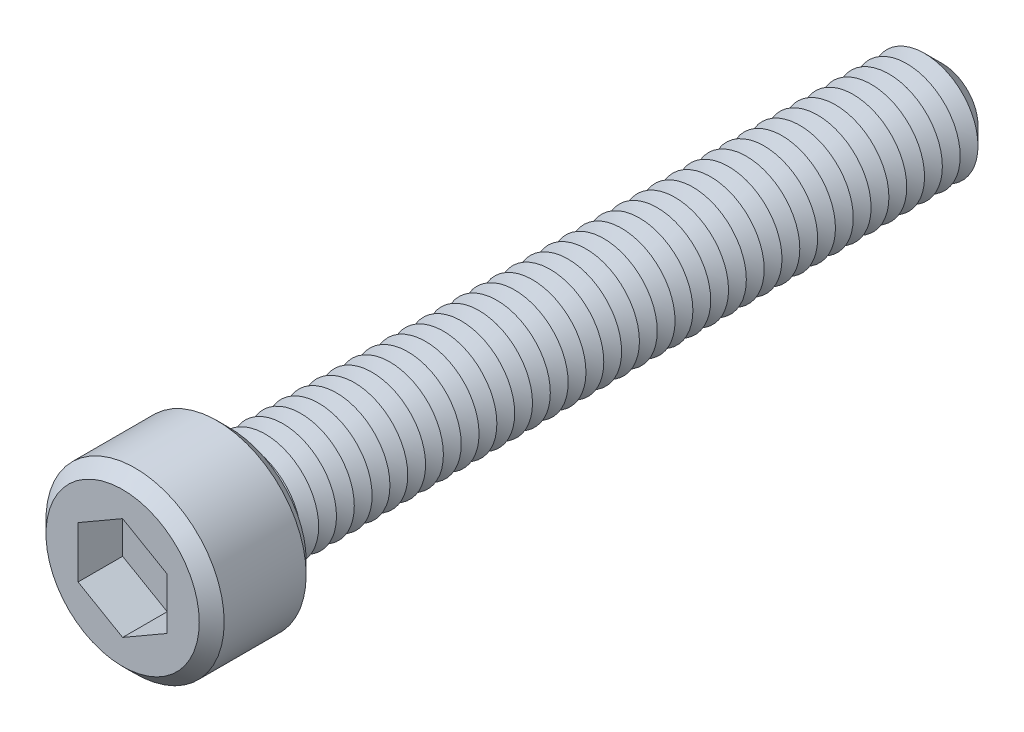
ISO-10303-21;
HEADER;
FILE_DESCRIPTION(('STEP AP214'),'2;1');
FILE_NAME('part.step','',(''),(''),'','','');
FILE_SCHEMA(('AUTOMOTIVE_DESIGN { 1 0 10303 214 1 1 1 1 }'));
ENDSEC;
DATA;
#1=APPLICATION_CONTEXT('core data for automotive mechanical design processes');
#2=APPLICATION_PROTOCOL_DEFINITION('international standard','automotive_design',2000,#1);
#3=PRODUCT_CONTEXT('',#1,'mechanical');
#4=PRODUCT('Part','Part','',(#3));
#5=PRODUCT_RELATED_PRODUCT_CATEGORY('part','',(#4));
#6=PRODUCT_DEFINITION_FORMATION('','',#4);
#7=PRODUCT_DEFINITION_CONTEXT('part definition',#1,'design');
#8=PRODUCT_DEFINITION('design','',#6,#7);
#9=PRODUCT_DEFINITION_SHAPE('','',#8);
#10=(LENGTH_UNIT() NAMED_UNIT(*) SI_UNIT(.MILLI.,.METRE.));
#11=(NAMED_UNIT(*) PLANE_ANGLE_UNIT() SI_UNIT($,.RADIAN.));
#12=(NAMED_UNIT(*) SI_UNIT($,.STERADIAN.) SOLID_ANGLE_UNIT());
#13=UNCERTAINTY_MEASURE_WITH_UNIT(LENGTH_MEASURE(1.E-05),#10,'distance_accuracy_value','');
#14=(GEOMETRIC_REPRESENTATION_CONTEXT(3) GLOBAL_UNCERTAINTY_ASSIGNED_CONTEXT((#13)) GLOBAL_UNIT_ASSIGNED_CONTEXT((#10,
#11,#12)) REPRESENTATION_CONTEXT('',''));
#15=CARTESIAN_POINT('',(0.,0.,0.));
#16=DIRECTION('',(0.,0.,1.));
#17=DIRECTION('',(1.,0.,0.));
#18=AXIS2_PLACEMENT_3D('',#15,#16,#17);
#19=CARTESIAN_POINT('',(0.,0.,6.));
#20=DIRECTION('',(0.,0.,-1.));
#21=DIRECTION('',(-1.,0.,0.));
#22=AXIS2_PLACEMENT_3D('',#19,#20,#21);
#23=CYLINDRICAL_SURFACE('',#22,5.);
#24=CARTESIAN_POINT('',(0.,0.,0.700000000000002));
#25=DIRECTION('',(0.,0.,1.));
#26=DIRECTION('',(1.,0.,0.));
#27=AXIS2_PLACEMENT_3D('',#24,#25,#26);
#28=CIRCLE('',#27,5.);
#29=CARTESIAN_POINT('',(5.,0.,0.700000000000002));
#30=VERTEX_POINT('',#29);
#31=EDGE_CURVE('E489',#30,#30,#28,.T.);
#32=ORIENTED_EDGE('',*,*,#31,.T.);
#33=EDGE_LOOP('',(#32));
#34=FACE_BOUND('',#33,.T.);
#35=CARTESIAN_POINT('',(0.,0.,5.30000000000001));
#36=DIRECTION('',(0.,0.,1.));
#37=DIRECTION('',(1.,0.,0.));
#38=AXIS2_PLACEMENT_3D('',#35,#36,#37);
#39=CIRCLE('',#38,5.);
#40=CARTESIAN_POINT('',(5.,0.,5.30000000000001));
#41=VERTEX_POINT('',#40);
#42=EDGE_CURVE('E485',#41,#41,#39,.F.);
#43=ORIENTED_EDGE('',*,*,#42,.T.);
#44=EDGE_LOOP('',(#43));
#45=FACE_BOUND('',#44,.T.);
#46=ADVANCED_FACE('F39',(#34,#45),#23,.T.);
#47=CARTESIAN_POINT('',(0.,0.,6.));
#48=DIRECTION('',(0.,0.,1.));
#49=DIRECTION('',(1.,0.,0.));
#50=AXIS2_PLACEMENT_3D('',#47,#48,#49);
#51=PLANE('',#50);
#52=CARTESIAN_POINT('',(0.,0.,6.));
#53=DIRECTION('',(0.,0.,1.));
#54=DIRECTION('',(1.,0.,0.));
#55=AXIS2_PLACEMENT_3D('',#52,#53,#54);
#56=CIRCLE('',#55,4.30000000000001);
#57=CARTESIAN_POINT('',(4.30000000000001,0.,6.));
#58=VERTEX_POINT('',#57);
#59=EDGE_CURVE('E11',#58,#58,#56,.T.);
#60=ORIENTED_EDGE('',*,*,#59,.T.);
#61=EDGE_LOOP('',(#60));
#62=FACE_BOUND('',#61,.T.);
#63=DIRECTION('',(-0.866025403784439,0.5,0.));
#64=VECTOR('',#63,1.);
#65=CARTESIAN_POINT('',(2.5,1.44337567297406,6.));
#66=LINE('',#65,#64);
#67=CARTESIAN_POINT('',(2.5,1.44337567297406,6.));
#68=VERTEX_POINT('',#67);
#69=CARTESIAN_POINT('',(0.,2.88675134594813,6.));
#70=VERTEX_POINT('',#69);
#71=EDGE_CURVE('E55',#68,#70,#66,.T.);
#72=ORIENTED_EDGE('',*,*,#71,.F.);
#73=DIRECTION('',(0.,1.,0.));
#74=VECTOR('',#73,1.);
#75=CARTESIAN_POINT('',(2.5,-1.44337567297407,6.));
#76=LINE('',#75,#74);
#77=CARTESIAN_POINT('',(2.5,-1.44337567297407,6.));
#78=VERTEX_POINT('',#77);
#79=EDGE_CURVE('E151',#78,#68,#76,.T.);
#80=ORIENTED_EDGE('',*,*,#79,.F.);
#81=DIRECTION('',(0.866025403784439,0.5,0.));
#82=VECTOR('',#81,1.);
#83=CARTESIAN_POINT('',(0.,-2.88675134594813,6.));
#84=LINE('',#83,#82);
#85=CARTESIAN_POINT('',(0.,-2.88675134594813,6.));
#86=VERTEX_POINT('',#85);
#87=EDGE_CURVE('E148',#86,#78,#84,.T.);
#88=ORIENTED_EDGE('',*,*,#87,.F.);
#89=DIRECTION('',(0.866025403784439,-0.5,0.));
#90=VECTOR('',#89,1.);
#91=CARTESIAN_POINT('',(-2.5,-1.44337567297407,6.));
#92=LINE('',#91,#90);
#93=CARTESIAN_POINT('',(-2.5,-1.44337567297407,6.));
#94=VERTEX_POINT('',#93);
#95=EDGE_CURVE('E103',#94,#86,#92,.T.);
#96=ORIENTED_EDGE('',*,*,#95,.F.);
#97=DIRECTION('',(0.,-1.,0.));
#98=VECTOR('',#97,1.);
#99=CARTESIAN_POINT('',(-2.5,1.44337567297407,6.));
#100=LINE('',#99,#98);
#101=CARTESIAN_POINT('',(-2.5,1.44337567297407,6.));
#102=VERTEX_POINT('',#101);
#103=EDGE_CURVE('E142',#102,#94,#100,.T.);
#104=ORIENTED_EDGE('',*,*,#103,.F.);
#105=DIRECTION('',(-0.866025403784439,-0.5,0.));
#106=VECTOR('',#105,1.);
#107=CARTESIAN_POINT('',(0.,2.88675134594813,6.));
#108=LINE('',#107,#106);
#109=EDGE_CURVE('E137',#70,#102,#108,.T.);
#110=ORIENTED_EDGE('',*,*,#109,.F.);
#111=EDGE_LOOP('',(#72,#80,#88,#96,#104,#110));
#112=FACE_BOUND('',#111,.T.);
#113=ADVANCED_FACE('F507',(#62,#112),#51,.T.);
#114=CARTESIAN_POINT('',(0.,0.,0.));
#115=DIRECTION('',(0.,0.,1.));
#116=DIRECTION('',(1.,0.,0.));
#117=AXIS2_PLACEMENT_3D('',#114,#115,#116);
#118=PLANE('',#117);
#119=CARTESIAN_POINT('',(0.,0.,0.));
#120=DIRECTION('',(0.,0.,1.));
#121=DIRECTION('',(1.,0.,0.));
#122=AXIS2_PLACEMENT_3D('',#119,#120,#121);
#123=CIRCLE('',#122,4.29999999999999);
#124=CARTESIAN_POINT('',(4.29999999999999,0.,0.));
#125=VERTEX_POINT('',#124);
#126=EDGE_CURVE('E48',#125,#125,#123,.F.);
#127=ORIENTED_EDGE('',*,*,#126,.T.);
#128=EDGE_LOOP('',(#127));
#129=FACE_BOUND('',#128,.T.);
#130=CARTESIAN_POINT('',(0.,0.,0.));
#131=DIRECTION('',(0.,0.,1.));
#132=DIRECTION('',(1.,0.,0.));
#133=AXIS2_PLACEMENT_3D('',#130,#131,#132);
#134=CIRCLE('',#133,3.);
#135=CARTESIAN_POINT('',(3.,0.,0.));
#136=VERTEX_POINT('',#135);
#137=EDGE_CURVE('E477',#136,#136,#134,.T.);
#138=ORIENTED_EDGE('',*,*,#137,.T.);
#139=EDGE_LOOP('',(#138));
#140=FACE_BOUND('',#139,.T.);
#141=ADVANCED_FACE('F496',(#129,#140),#118,.F.);
#142=CARTESIAN_POINT('',(0.,0.,0.));
#143=DIRECTION('',(0.,0.,1.));
#144=DIRECTION('',(1.,0.,0.));
#145=AXIS2_PLACEMENT_3D('',#142,#143,#144);
#146=CONICAL_SURFACE('',#145,3.,1.0471975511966);
#147=CARTESIAN_POINT('',(0.,0.,-0.500000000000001));
#148=DIRECTION('',(0.,0.,1.));
#149=DIRECTION('',(1.,0.,0.));
#150=AXIS2_PLACEMENT_3D('',#147,#148,#149);
#151=CIRCLE('',#150,2.13397459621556);
#152=CARTESIAN_POINT('',(2.13397459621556,0.,-0.500000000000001));
#153=VERTEX_POINT('',#152);
#154=EDGE_CURVE('E473',#153,#153,#151,.T.);
#155=ORIENTED_EDGE('',*,*,#154,.T.);
#156=EDGE_LOOP('',(#155));
#157=FACE_BOUND('',#156,.T.);
#158=ORIENTED_EDGE('',*,*,#137,.F.);
#159=EDGE_LOOP('',(#158));
#160=FACE_BOUND('',#159,.T.);
#161=ADVANCED_FACE('F868',(#157,#160),#146,.T.);
#162=CARTESIAN_POINT('',(0.,0.,-0.500000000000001));
#163=DIRECTION('',(0.,0.,-1.));
#164=DIRECTION('',(-1.,0.,0.));
#165=AXIS2_PLACEMENT_3D('',#162,#163,#164);
#166=CONICAL_SURFACE('',#165,2.13397459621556,1.0471975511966);
#167=CARTESIAN_POINT('',(0.,0.,-1.));
#168=DIRECTION('',(0.,0.,1.));
#169=DIRECTION('',(1.,0.,0.));
#170=AXIS2_PLACEMENT_3D('',#167,#168,#169);
#171=CIRCLE('',#170,3.);
#172=CARTESIAN_POINT('',(3.,0.,-1.));
#173=VERTEX_POINT('',#172);
#174=EDGE_CURVE('E469',#173,#173,#171,.T.);
#175=ORIENTED_EDGE('',*,*,#174,.T.);
#176=EDGE_LOOP('',(#175));
#177=FACE_BOUND('',#176,.T.);
#178=ORIENTED_EDGE('',*,*,#154,.F.);
#179=EDGE_LOOP('',(#178));
#180=FACE_BOUND('',#179,.T.);
#181=ADVANCED_FACE('F864',(#177,#180),#166,.T.);
#182=CARTESIAN_POINT('',(0.,0.,-1.));
#183=DIRECTION('',(0.,0.,1.));
#184=DIRECTION('',(1.,0.,0.));
#185=AXIS2_PLACEMENT_3D('',#182,#183,#184);
#186=CONICAL_SURFACE('',#185,3.,1.0471975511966);
#187=CARTESIAN_POINT('',(0.,0.,-1.5));
#188=DIRECTION('',(0.,0.,1.));
#189=DIRECTION('',(1.,0.,0.));
#190=AXIS2_PLACEMENT_3D('',#187,#188,#189);
#191=CIRCLE('',#190,2.13397459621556);
#192=CARTESIAN_POINT('',(2.13397459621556,0.,-1.5));
#193=VERTEX_POINT('',#192);
#194=EDGE_CURVE('E465',#193,#193,#191,.T.);
#195=ORIENTED_EDGE('',*,*,#194,.T.);
#196=EDGE_LOOP('',(#195));
#197=FACE_BOUND('',#196,.T.);
#198=ORIENTED_EDGE('',*,*,#174,.F.);
#199=EDGE_LOOP('',(#198));
#200=FACE_BOUND('',#199,.T.);
#201=ADVANCED_FACE('F860',(#197,#200),#186,.T.);
#202=CARTESIAN_POINT('',(0.,0.,-1.5));
#203=DIRECTION('',(0.,0.,-1.));
#204=DIRECTION('',(-1.,0.,0.));
#205=AXIS2_PLACEMENT_3D('',#202,#203,#204);
#206=CONICAL_SURFACE('',#205,2.13397459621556,1.0471975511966);
#207=CARTESIAN_POINT('',(0.,0.,-2.));
#208=DIRECTION('',(0.,0.,1.));
#209=DIRECTION('',(1.,0.,0.));
#210=AXIS2_PLACEMENT_3D('',#207,#208,#209);
#211=CIRCLE('',#210,3.);
#212=CARTESIAN_POINT('',(3.,0.,-2.));
#213=VERTEX_POINT('',#212);
#214=EDGE_CURVE('E461',#213,#213,#211,.T.);
#215=ORIENTED_EDGE('',*,*,#214,.T.);
#216=EDGE_LOOP('',(#215));
#217=FACE_BOUND('',#216,.T.);
#218=ORIENTED_EDGE('',*,*,#194,.F.);
#219=EDGE_LOOP('',(#218));
#220=FACE_BOUND('',#219,.T.);
#221=ADVANCED_FACE('F856',(#217,#220),#206,.T.);
#222=CARTESIAN_POINT('',(0.,0.,-2.));
#223=DIRECTION('',(0.,0.,1.));
#224=DIRECTION('',(1.,0.,0.));
#225=AXIS2_PLACEMENT_3D('',#222,#223,#224);
#226=CONICAL_SURFACE('',#225,3.,1.0471975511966);
#227=CARTESIAN_POINT('',(0.,0.,-2.5));
#228=DIRECTION('',(0.,0.,1.));
#229=DIRECTION('',(1.,0.,0.));
#230=AXIS2_PLACEMENT_3D('',#227,#228,#229);
#231=CIRCLE('',#230,2.13397459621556);
#232=CARTESIAN_POINT('',(2.13397459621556,0.,-2.5));
#233=VERTEX_POINT('',#232);
#234=EDGE_CURVE('E457',#233,#233,#231,.T.);
#235=ORIENTED_EDGE('',*,*,#234,.T.);
#236=EDGE_LOOP('',(#235));
#237=FACE_BOUND('',#236,.T.);
#238=ORIENTED_EDGE('',*,*,#214,.F.);
#239=EDGE_LOOP('',(#238));
#240=FACE_BOUND('',#239,.T.);
#241=ADVANCED_FACE('F852',(#237,#240),#226,.T.);
#242=CARTESIAN_POINT('',(0.,0.,-2.5));
#243=DIRECTION('',(0.,0.,-1.));
#244=DIRECTION('',(-1.,0.,0.));
#245=AXIS2_PLACEMENT_3D('',#242,#243,#244);
#246=CONICAL_SURFACE('',#245,2.13397459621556,1.0471975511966);
#247=CARTESIAN_POINT('',(0.,0.,-3.));
#248=DIRECTION('',(0.,0.,1.));
#249=DIRECTION('',(1.,0.,0.));
#250=AXIS2_PLACEMENT_3D('',#247,#248,#249);
#251=CIRCLE('',#250,3.);
#252=CARTESIAN_POINT('',(3.,0.,-3.));
#253=VERTEX_POINT('',#252);
#254=EDGE_CURVE('E453',#253,#253,#251,.T.);
#255=ORIENTED_EDGE('',*,*,#254,.T.);
#256=EDGE_LOOP('',(#255));
#257=FACE_BOUND('',#256,.T.);
#258=ORIENTED_EDGE('',*,*,#234,.F.);
#259=EDGE_LOOP('',(#258));
#260=FACE_BOUND('',#259,.T.);
#261=ADVANCED_FACE('F848',(#257,#260),#246,.T.);
#262=CARTESIAN_POINT('',(0.,0.,-3.));
#263=DIRECTION('',(0.,0.,1.));
#264=DIRECTION('',(1.,0.,0.));
#265=AXIS2_PLACEMENT_3D('',#262,#263,#264);
#266=CONICAL_SURFACE('',#265,3.,1.0471975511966);
#267=CARTESIAN_POINT('',(0.,0.,-3.5));
#268=DIRECTION('',(0.,0.,1.));
#269=DIRECTION('',(1.,0.,0.));
#270=AXIS2_PLACEMENT_3D('',#267,#268,#269);
#271=CIRCLE('',#270,2.13397459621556);
#272=CARTESIAN_POINT('',(2.13397459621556,0.,-3.5));
#273=VERTEX_POINT('',#272);
#274=EDGE_CURVE('E449',#273,#273,#271,.T.);
#275=ORIENTED_EDGE('',*,*,#274,.T.);
#276=EDGE_LOOP('',(#275));
#277=FACE_BOUND('',#276,.T.);
#278=ORIENTED_EDGE('',*,*,#254,.F.);
#279=EDGE_LOOP('',(#278));
#280=FACE_BOUND('',#279,.T.);
#281=ADVANCED_FACE('F844',(#277,#280),#266,.T.);
#282=CARTESIAN_POINT('',(0.,0.,-3.5));
#283=DIRECTION('',(0.,0.,-1.));
#284=DIRECTION('',(-1.,0.,0.));
#285=AXIS2_PLACEMENT_3D('',#282,#283,#284);
#286=CONICAL_SURFACE('',#285,2.13397459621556,1.0471975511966);
#287=CARTESIAN_POINT('',(0.,0.,-4.));
#288=DIRECTION('',(0.,0.,1.));
#289=DIRECTION('',(1.,0.,0.));
#290=AXIS2_PLACEMENT_3D('',#287,#288,#289);
#291=CIRCLE('',#290,3.);
#292=CARTESIAN_POINT('',(3.,0.,-4.));
#293=VERTEX_POINT('',#292);
#294=EDGE_CURVE('E445',#293,#293,#291,.T.);
#295=ORIENTED_EDGE('',*,*,#294,.T.);
#296=EDGE_LOOP('',(#295));
#297=FACE_BOUND('',#296,.T.);
#298=ORIENTED_EDGE('',*,*,#274,.F.);
#299=EDGE_LOOP('',(#298));
#300=FACE_BOUND('',#299,.T.);
#301=ADVANCED_FACE('F840',(#297,#300),#286,.T.);
#302=CARTESIAN_POINT('',(0.,0.,-4.));
#303=DIRECTION('',(0.,0.,1.));
#304=DIRECTION('',(1.,0.,0.));
#305=AXIS2_PLACEMENT_3D('',#302,#303,#304);
#306=CONICAL_SURFACE('',#305,3.,1.0471975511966);
#307=CARTESIAN_POINT('',(0.,0.,-4.5));
#308=DIRECTION('',(0.,0.,1.));
#309=DIRECTION('',(1.,0.,0.));
#310=AXIS2_PLACEMENT_3D('',#307,#308,#309);
#311=CIRCLE('',#310,2.13397459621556);
#312=CARTESIAN_POINT('',(2.13397459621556,0.,-4.5));
#313=VERTEX_POINT('',#312);
#314=EDGE_CURVE('E441',#313,#313,#311,.T.);
#315=ORIENTED_EDGE('',*,*,#314,.T.);
#316=EDGE_LOOP('',(#315));
#317=FACE_BOUND('',#316,.T.);
#318=ORIENTED_EDGE('',*,*,#294,.F.);
#319=EDGE_LOOP('',(#318));
#320=FACE_BOUND('',#319,.T.);
#321=ADVANCED_FACE('F836',(#317,#320),#306,.T.);
#322=CARTESIAN_POINT('',(0.,0.,-4.5));
#323=DIRECTION('',(0.,0.,-1.));
#324=DIRECTION('',(-1.,0.,0.));
#325=AXIS2_PLACEMENT_3D('',#322,#323,#324);
#326=CONICAL_SURFACE('',#325,2.13397459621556,1.0471975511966);
#327=CARTESIAN_POINT('',(0.,0.,-5.));
#328=DIRECTION('',(0.,0.,1.));
#329=DIRECTION('',(1.,0.,0.));
#330=AXIS2_PLACEMENT_3D('',#327,#328,#329);
#331=CIRCLE('',#330,3.);
#332=CARTESIAN_POINT('',(3.,0.,-5.));
#333=VERTEX_POINT('',#332);
#334=EDGE_CURVE('E437',#333,#333,#331,.T.);
#335=ORIENTED_EDGE('',*,*,#334,.T.);
#336=EDGE_LOOP('',(#335));
#337=FACE_BOUND('',#336,.T.);
#338=ORIENTED_EDGE('',*,*,#314,.F.);
#339=EDGE_LOOP('',(#338));
#340=FACE_BOUND('',#339,.T.);
#341=ADVANCED_FACE('F832',(#337,#340),#326,.T.);
#342=CARTESIAN_POINT('',(0.,0.,-5.));
#343=DIRECTION('',(0.,0.,1.));
#344=DIRECTION('',(1.,0.,0.));
#345=AXIS2_PLACEMENT_3D('',#342,#343,#344);
#346=CONICAL_SURFACE('',#345,3.,1.0471975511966);
#347=CARTESIAN_POINT('',(0.,0.,-5.5));
#348=DIRECTION('',(0.,0.,1.));
#349=DIRECTION('',(1.,0.,0.));
#350=AXIS2_PLACEMENT_3D('',#347,#348,#349);
#351=CIRCLE('',#350,2.13397459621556);
#352=CARTESIAN_POINT('',(2.13397459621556,0.,-5.5));
#353=VERTEX_POINT('',#352);
#354=EDGE_CURVE('E433',#353,#353,#351,.T.);
#355=ORIENTED_EDGE('',*,*,#354,.T.);
#356=EDGE_LOOP('',(#355));
#357=FACE_BOUND('',#356,.T.);
#358=ORIENTED_EDGE('',*,*,#334,.F.);
#359=EDGE_LOOP('',(#358));
#360=FACE_BOUND('',#359,.T.);
#361=ADVANCED_FACE('F828',(#357,#360),#346,.T.);
#362=CARTESIAN_POINT('',(0.,0.,-5.5));
#363=DIRECTION('',(0.,0.,-1.));
#364=DIRECTION('',(-1.,0.,0.));
#365=AXIS2_PLACEMENT_3D('',#362,#363,#364);
#366=CONICAL_SURFACE('',#365,2.13397459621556,1.0471975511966);
#367=CARTESIAN_POINT('',(0.,0.,-6.));
#368=DIRECTION('',(0.,0.,1.));
#369=DIRECTION('',(1.,0.,0.));
#370=AXIS2_PLACEMENT_3D('',#367,#368,#369);
#371=CIRCLE('',#370,3.);
#372=CARTESIAN_POINT('',(3.,0.,-6.));
#373=VERTEX_POINT('',#372);
#374=EDGE_CURVE('E429',#373,#373,#371,.T.);
#375=ORIENTED_EDGE('',*,*,#374,.T.);
#376=EDGE_LOOP('',(#375));
#377=FACE_BOUND('',#376,.T.);
#378=ORIENTED_EDGE('',*,*,#354,.F.);
#379=EDGE_LOOP('',(#378));
#380=FACE_BOUND('',#379,.T.);
#381=ADVANCED_FACE('F824',(#377,#380),#366,.T.);
#382=CARTESIAN_POINT('',(0.,0.,-6.));
#383=DIRECTION('',(0.,0.,1.));
#384=DIRECTION('',(1.,0.,0.));
#385=AXIS2_PLACEMENT_3D('',#382,#383,#384);
#386=CONICAL_SURFACE('',#385,3.,1.0471975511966);
#387=CARTESIAN_POINT('',(0.,0.,-6.5));
#388=DIRECTION('',(0.,0.,1.));
#389=DIRECTION('',(1.,0.,0.));
#390=AXIS2_PLACEMENT_3D('',#387,#388,#389);
#391=CIRCLE('',#390,2.13397459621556);
#392=CARTESIAN_POINT('',(2.13397459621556,0.,-6.5));
#393=VERTEX_POINT('',#392);
#394=EDGE_CURVE('E425',#393,#393,#391,.T.);
#395=ORIENTED_EDGE('',*,*,#394,.T.);
#396=EDGE_LOOP('',(#395));
#397=FACE_BOUND('',#396,.T.);
#398=ORIENTED_EDGE('',*,*,#374,.F.);
#399=EDGE_LOOP('',(#398));
#400=FACE_BOUND('',#399,.T.);
#401=ADVANCED_FACE('F820',(#397,#400),#386,.T.);
#402=CARTESIAN_POINT('',(0.,0.,-6.5));
#403=DIRECTION('',(0.,0.,-1.));
#404=DIRECTION('',(-1.,0.,0.));
#405=AXIS2_PLACEMENT_3D('',#402,#403,#404);
#406=CONICAL_SURFACE('',#405,2.13397459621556,1.0471975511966);
#407=CARTESIAN_POINT('',(0.,0.,-7.));
#408=DIRECTION('',(0.,0.,1.));
#409=DIRECTION('',(1.,0.,0.));
#410=AXIS2_PLACEMENT_3D('',#407,#408,#409);
#411=CIRCLE('',#410,3.);
#412=CARTESIAN_POINT('',(3.,0.,-7.));
#413=VERTEX_POINT('',#412);
#414=EDGE_CURVE('E421',#413,#413,#411,.T.);
#415=ORIENTED_EDGE('',*,*,#414,.T.);
#416=EDGE_LOOP('',(#415));
#417=FACE_BOUND('',#416,.T.);
#418=ORIENTED_EDGE('',*,*,#394,.F.);
#419=EDGE_LOOP('',(#418));
#420=FACE_BOUND('',#419,.T.);
#421=ADVANCED_FACE('F816',(#417,#420),#406,.T.);
#422=CARTESIAN_POINT('',(0.,0.,-7.));
#423=DIRECTION('',(0.,0.,1.));
#424=DIRECTION('',(1.,0.,0.));
#425=AXIS2_PLACEMENT_3D('',#422,#423,#424);
#426=CONICAL_SURFACE('',#425,3.,1.0471975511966);
#427=CARTESIAN_POINT('',(0.,0.,-7.5));
#428=DIRECTION('',(0.,0.,1.));
#429=DIRECTION('',(1.,0.,0.));
#430=AXIS2_PLACEMENT_3D('',#427,#428,#429);
#431=CIRCLE('',#430,2.13397459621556);
#432=CARTESIAN_POINT('',(2.13397459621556,0.,-7.5));
#433=VERTEX_POINT('',#432);
#434=EDGE_CURVE('E417',#433,#433,#431,.T.);
#435=ORIENTED_EDGE('',*,*,#434,.T.);
#436=EDGE_LOOP('',(#435));
#437=FACE_BOUND('',#436,.T.);
#438=ORIENTED_EDGE('',*,*,#414,.F.);
#439=EDGE_LOOP('',(#438));
#440=FACE_BOUND('',#439,.T.);
#441=ADVANCED_FACE('F812',(#437,#440),#426,.T.);
#442=CARTESIAN_POINT('',(0.,0.,-7.5));
#443=DIRECTION('',(0.,0.,-1.));
#444=DIRECTION('',(-1.,0.,0.));
#445=AXIS2_PLACEMENT_3D('',#442,#443,#444);
#446=CONICAL_SURFACE('',#445,2.13397459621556,1.0471975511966);
#447=CARTESIAN_POINT('',(0.,0.,-8.));
#448=DIRECTION('',(0.,0.,1.));
#449=DIRECTION('',(1.,0.,0.));
#450=AXIS2_PLACEMENT_3D('',#447,#448,#449);
#451=CIRCLE('',#450,3.);
#452=CARTESIAN_POINT('',(3.,0.,-8.));
#453=VERTEX_POINT('',#452);
#454=EDGE_CURVE('E413',#453,#453,#451,.T.);
#455=ORIENTED_EDGE('',*,*,#454,.T.);
#456=EDGE_LOOP('',(#455));
#457=FACE_BOUND('',#456,.T.);
#458=ORIENTED_EDGE('',*,*,#434,.F.);
#459=EDGE_LOOP('',(#458));
#460=FACE_BOUND('',#459,.T.);
#461=ADVANCED_FACE('F808',(#457,#460),#446,.T.);
#462=CARTESIAN_POINT('',(0.,0.,-8.));
#463=DIRECTION('',(0.,0.,1.));
#464=DIRECTION('',(1.,0.,0.));
#465=AXIS2_PLACEMENT_3D('',#462,#463,#464);
#466=CONICAL_SURFACE('',#465,3.,1.0471975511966);
#467=CARTESIAN_POINT('',(0.,0.,-8.5));
#468=DIRECTION('',(0.,0.,1.));
#469=DIRECTION('',(1.,0.,0.));
#470=AXIS2_PLACEMENT_3D('',#467,#468,#469);
#471=CIRCLE('',#470,2.13397459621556);
#472=CARTESIAN_POINT('',(2.13397459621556,0.,-8.5));
#473=VERTEX_POINT('',#472);
#474=EDGE_CURVE('E409',#473,#473,#471,.T.);
#475=ORIENTED_EDGE('',*,*,#474,.T.);
#476=EDGE_LOOP('',(#475));
#477=FACE_BOUND('',#476,.T.);
#478=ORIENTED_EDGE('',*,*,#454,.F.);
#479=EDGE_LOOP('',(#478));
#480=FACE_BOUND('',#479,.T.);
#481=ADVANCED_FACE('F804',(#477,#480),#466,.T.);
#482=CARTESIAN_POINT('',(0.,0.,-8.5));
#483=DIRECTION('',(0.,0.,-1.));
#484=DIRECTION('',(-1.,0.,0.));
#485=AXIS2_PLACEMENT_3D('',#482,#483,#484);
#486=CONICAL_SURFACE('',#485,2.13397459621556,1.0471975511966);
#487=CARTESIAN_POINT('',(0.,0.,-9.));
#488=DIRECTION('',(0.,0.,1.));
#489=DIRECTION('',(1.,0.,0.));
#490=AXIS2_PLACEMENT_3D('',#487,#488,#489);
#491=CIRCLE('',#490,3.);
#492=CARTESIAN_POINT('',(3.,0.,-9.));
#493=VERTEX_POINT('',#492);
#494=EDGE_CURVE('E405',#493,#493,#491,.T.);
#495=ORIENTED_EDGE('',*,*,#494,.T.);
#496=EDGE_LOOP('',(#495));
#497=FACE_BOUND('',#496,.T.);
#498=ORIENTED_EDGE('',*,*,#474,.F.);
#499=EDGE_LOOP('',(#498));
#500=FACE_BOUND('',#499,.T.);
#501=ADVANCED_FACE('F800',(#497,#500),#486,.T.);
#502=CARTESIAN_POINT('',(0.,0.,-9.));
#503=DIRECTION('',(0.,0.,1.));
#504=DIRECTION('',(1.,0.,0.));
#505=AXIS2_PLACEMENT_3D('',#502,#503,#504);
#506=CONICAL_SURFACE('',#505,3.,1.0471975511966);
#507=CARTESIAN_POINT('',(0.,0.,-9.5));
#508=DIRECTION('',(0.,0.,1.));
#509=DIRECTION('',(1.,0.,0.));
#510=AXIS2_PLACEMENT_3D('',#507,#508,#509);
#511=CIRCLE('',#510,2.13397459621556);
#512=CARTESIAN_POINT('',(2.13397459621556,0.,-9.5));
#513=VERTEX_POINT('',#512);
#514=EDGE_CURVE('E401',#513,#513,#511,.T.);
#515=ORIENTED_EDGE('',*,*,#514,.T.);
#516=EDGE_LOOP('',(#515));
#517=FACE_BOUND('',#516,.T.);
#518=ORIENTED_EDGE('',*,*,#494,.F.);
#519=EDGE_LOOP('',(#518));
#520=FACE_BOUND('',#519,.T.);
#521=ADVANCED_FACE('F796',(#517,#520),#506,.T.);
#522=CARTESIAN_POINT('',(0.,0.,-9.5));
#523=DIRECTION('',(0.,0.,-1.));
#524=DIRECTION('',(-1.,0.,0.));
#525=AXIS2_PLACEMENT_3D('',#522,#523,#524);
#526=CONICAL_SURFACE('',#525,2.13397459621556,1.0471975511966);
#527=CARTESIAN_POINT('',(0.,0.,-10.));
#528=DIRECTION('',(0.,0.,1.));
#529=DIRECTION('',(1.,0.,0.));
#530=AXIS2_PLACEMENT_3D('',#527,#528,#529);
#531=CIRCLE('',#530,3.);
#532=CARTESIAN_POINT('',(3.,0.,-10.));
#533=VERTEX_POINT('',#532);
#534=EDGE_CURVE('E397',#533,#533,#531,.T.);
#535=ORIENTED_EDGE('',*,*,#534,.T.);
#536=EDGE_LOOP('',(#535));
#537=FACE_BOUND('',#536,.T.);
#538=ORIENTED_EDGE('',*,*,#514,.F.);
#539=EDGE_LOOP('',(#538));
#540=FACE_BOUND('',#539,.T.);
#541=ADVANCED_FACE('F792',(#537,#540),#526,.T.);
#542=CARTESIAN_POINT('',(0.,0.,-10.));
#543=DIRECTION('',(0.,0.,1.));
#544=DIRECTION('',(1.,0.,0.));
#545=AXIS2_PLACEMENT_3D('',#542,#543,#544);
#546=CONICAL_SURFACE('',#545,3.,1.0471975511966);
#547=CARTESIAN_POINT('',(0.,0.,-10.5));
#548=DIRECTION('',(0.,0.,1.));
#549=DIRECTION('',(1.,0.,0.));
#550=AXIS2_PLACEMENT_3D('',#547,#548,#549);
#551=CIRCLE('',#550,2.13397459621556);
#552=CARTESIAN_POINT('',(2.13397459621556,0.,-10.5));
#553=VERTEX_POINT('',#552);
#554=EDGE_CURVE('E393',#553,#553,#551,.T.);
#555=ORIENTED_EDGE('',*,*,#554,.T.);
#556=EDGE_LOOP('',(#555));
#557=FACE_BOUND('',#556,.T.);
#558=ORIENTED_EDGE('',*,*,#534,.F.);
#559=EDGE_LOOP('',(#558));
#560=FACE_BOUND('',#559,.T.);
#561=ADVANCED_FACE('F788',(#557,#560),#546,.T.);
#562=CARTESIAN_POINT('',(0.,0.,-10.5));
#563=DIRECTION('',(0.,0.,-1.));
#564=DIRECTION('',(-1.,0.,0.));
#565=AXIS2_PLACEMENT_3D('',#562,#563,#564);
#566=CONICAL_SURFACE('',#565,2.13397459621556,1.0471975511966);
#567=CARTESIAN_POINT('',(0.,0.,-11.));
#568=DIRECTION('',(0.,0.,1.));
#569=DIRECTION('',(1.,0.,0.));
#570=AXIS2_PLACEMENT_3D('',#567,#568,#569);
#571=CIRCLE('',#570,3.);
#572=CARTESIAN_POINT('',(3.,0.,-11.));
#573=VERTEX_POINT('',#572);
#574=EDGE_CURVE('E389',#573,#573,#571,.T.);
#575=ORIENTED_EDGE('',*,*,#574,.T.);
#576=EDGE_LOOP('',(#575));
#577=FACE_BOUND('',#576,.T.);
#578=ORIENTED_EDGE('',*,*,#554,.F.);
#579=EDGE_LOOP('',(#578));
#580=FACE_BOUND('',#579,.T.);
#581=ADVANCED_FACE('F784',(#577,#580),#566,.T.);
#582=CARTESIAN_POINT('',(0.,0.,-11.));
#583=DIRECTION('',(0.,0.,1.));
#584=DIRECTION('',(1.,0.,0.));
#585=AXIS2_PLACEMENT_3D('',#582,#583,#584);
#586=CONICAL_SURFACE('',#585,3.,1.0471975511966);
#587=CARTESIAN_POINT('',(0.,0.,-11.5));
#588=DIRECTION('',(0.,0.,1.));
#589=DIRECTION('',(1.,0.,0.));
#590=AXIS2_PLACEMENT_3D('',#587,#588,#589);
#591=CIRCLE('',#590,2.13397459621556);
#592=CARTESIAN_POINT('',(2.13397459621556,0.,-11.5));
#593=VERTEX_POINT('',#592);
#594=EDGE_CURVE('E385',#593,#593,#591,.T.);
#595=ORIENTED_EDGE('',*,*,#594,.T.);
#596=EDGE_LOOP('',(#595));
#597=FACE_BOUND('',#596,.T.);
#598=ORIENTED_EDGE('',*,*,#574,.F.);
#599=EDGE_LOOP('',(#598));
#600=FACE_BOUND('',#599,.T.);
#601=ADVANCED_FACE('F780',(#597,#600),#586,.T.);
#602=CARTESIAN_POINT('',(0.,0.,-11.5));
#603=DIRECTION('',(0.,0.,-1.));
#604=DIRECTION('',(-1.,0.,0.));
#605=AXIS2_PLACEMENT_3D('',#602,#603,#604);
#606=CONICAL_SURFACE('',#605,2.13397459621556,1.0471975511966);
#607=CARTESIAN_POINT('',(0.,0.,-12.));
#608=DIRECTION('',(0.,0.,1.));
#609=DIRECTION('',(1.,0.,0.));
#610=AXIS2_PLACEMENT_3D('',#607,#608,#609);
#611=CIRCLE('',#610,3.);
#612=CARTESIAN_POINT('',(3.,0.,-12.));
#613=VERTEX_POINT('',#612);
#614=EDGE_CURVE('E381',#613,#613,#611,.T.);
#615=ORIENTED_EDGE('',*,*,#614,.T.);
#616=EDGE_LOOP('',(#615));
#617=FACE_BOUND('',#616,.T.);
#618=ORIENTED_EDGE('',*,*,#594,.F.);
#619=EDGE_LOOP('',(#618));
#620=FACE_BOUND('',#619,.T.);
#621=ADVANCED_FACE('F776',(#617,#620),#606,.T.);
#622=CARTESIAN_POINT('',(0.,0.,-12.));
#623=DIRECTION('',(0.,0.,1.));
#624=DIRECTION('',(1.,0.,0.));
#625=AXIS2_PLACEMENT_3D('',#622,#623,#624);
#626=CONICAL_SURFACE('',#625,3.,1.0471975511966);
#627=CARTESIAN_POINT('',(0.,0.,-12.5));
#628=DIRECTION('',(0.,0.,1.));
#629=DIRECTION('',(1.,0.,0.));
#630=AXIS2_PLACEMENT_3D('',#627,#628,#629);
#631=CIRCLE('',#630,2.13397459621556);
#632=CARTESIAN_POINT('',(2.13397459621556,0.,-12.5));
#633=VERTEX_POINT('',#632);
#634=EDGE_CURVE('E377',#633,#633,#631,.T.);
#635=ORIENTED_EDGE('',*,*,#634,.T.);
#636=EDGE_LOOP('',(#635));
#637=FACE_BOUND('',#636,.T.);
#638=ORIENTED_EDGE('',*,*,#614,.F.);
#639=EDGE_LOOP('',(#638));
#640=FACE_BOUND('',#639,.T.);
#641=ADVANCED_FACE('F772',(#637,#640),#626,.T.);
#642=CARTESIAN_POINT('',(0.,0.,-12.5));
#643=DIRECTION('',(0.,0.,-1.));
#644=DIRECTION('',(-1.,0.,0.));
#645=AXIS2_PLACEMENT_3D('',#642,#643,#644);
#646=CONICAL_SURFACE('',#645,2.13397459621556,1.0471975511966);
#647=CARTESIAN_POINT('',(0.,0.,-13.));
#648=DIRECTION('',(0.,0.,1.));
#649=DIRECTION('',(1.,0.,0.));
#650=AXIS2_PLACEMENT_3D('',#647,#648,#649);
#651=CIRCLE('',#650,3.);
#652=CARTESIAN_POINT('',(3.,0.,-13.));
#653=VERTEX_POINT('',#652);
#654=EDGE_CURVE('E373',#653,#653,#651,.T.);
#655=ORIENTED_EDGE('',*,*,#654,.T.);
#656=EDGE_LOOP('',(#655));
#657=FACE_BOUND('',#656,.T.);
#658=ORIENTED_EDGE('',*,*,#634,.F.);
#659=EDGE_LOOP('',(#658));
#660=FACE_BOUND('',#659,.T.);
#661=ADVANCED_FACE('F768',(#657,#660),#646,.T.);
#662=CARTESIAN_POINT('',(0.,0.,-13.));
#663=DIRECTION('',(0.,0.,1.));
#664=DIRECTION('',(1.,0.,0.));
#665=AXIS2_PLACEMENT_3D('',#662,#663,#664);
#666=CONICAL_SURFACE('',#665,3.,1.0471975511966);
#667=CARTESIAN_POINT('',(0.,0.,-13.5));
#668=DIRECTION('',(0.,0.,1.));
#669=DIRECTION('',(1.,0.,0.));
#670=AXIS2_PLACEMENT_3D('',#667,#668,#669);
#671=CIRCLE('',#670,2.13397459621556);
#672=CARTESIAN_POINT('',(2.13397459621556,0.,-13.5));
#673=VERTEX_POINT('',#672);
#674=EDGE_CURVE('E369',#673,#673,#671,.T.);
#675=ORIENTED_EDGE('',*,*,#674,.T.);
#676=EDGE_LOOP('',(#675));
#677=FACE_BOUND('',#676,.T.);
#678=ORIENTED_EDGE('',*,*,#654,.F.);
#679=EDGE_LOOP('',(#678));
#680=FACE_BOUND('',#679,.T.);
#681=ADVANCED_FACE('F764',(#677,#680),#666,.T.);
#682=CARTESIAN_POINT('',(0.,0.,-13.5));
#683=DIRECTION('',(0.,0.,-1.));
#684=DIRECTION('',(-1.,0.,0.));
#685=AXIS2_PLACEMENT_3D('',#682,#683,#684);
#686=CONICAL_SURFACE('',#685,2.13397459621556,1.0471975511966);
#687=CARTESIAN_POINT('',(0.,0.,-14.));
#688=DIRECTION('',(0.,0.,1.));
#689=DIRECTION('',(1.,0.,0.));
#690=AXIS2_PLACEMENT_3D('',#687,#688,#689);
#691=CIRCLE('',#690,3.);
#692=CARTESIAN_POINT('',(3.,0.,-14.));
#693=VERTEX_POINT('',#692);
#694=EDGE_CURVE('E365',#693,#693,#691,.T.);
#695=ORIENTED_EDGE('',*,*,#694,.T.);
#696=EDGE_LOOP('',(#695));
#697=FACE_BOUND('',#696,.T.);
#698=ORIENTED_EDGE('',*,*,#674,.F.);
#699=EDGE_LOOP('',(#698));
#700=FACE_BOUND('',#699,.T.);
#701=ADVANCED_FACE('F760',(#697,#700),#686,.T.);
#702=CARTESIAN_POINT('',(0.,0.,-14.));
#703=DIRECTION('',(0.,0.,1.));
#704=DIRECTION('',(1.,0.,0.));
#705=AXIS2_PLACEMENT_3D('',#702,#703,#704);
#706=CONICAL_SURFACE('',#705,3.,1.0471975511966);
#707=CARTESIAN_POINT('',(0.,0.,-14.5));
#708=DIRECTION('',(0.,0.,1.));
#709=DIRECTION('',(1.,0.,0.));
#710=AXIS2_PLACEMENT_3D('',#707,#708,#709);
#711=CIRCLE('',#710,2.13397459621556);
#712=CARTESIAN_POINT('',(2.13397459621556,0.,-14.5));
#713=VERTEX_POINT('',#712);
#714=EDGE_CURVE('E361',#713,#713,#711,.T.);
#715=ORIENTED_EDGE('',*,*,#714,.T.);
#716=EDGE_LOOP('',(#715));
#717=FACE_BOUND('',#716,.T.);
#718=ORIENTED_EDGE('',*,*,#694,.F.);
#719=EDGE_LOOP('',(#718));
#720=FACE_BOUND('',#719,.T.);
#721=ADVANCED_FACE('F756',(#717,#720),#706,.T.);
#722=CARTESIAN_POINT('',(0.,0.,-14.5));
#723=DIRECTION('',(0.,0.,-1.));
#724=DIRECTION('',(-1.,0.,0.));
#725=AXIS2_PLACEMENT_3D('',#722,#723,#724);
#726=CONICAL_SURFACE('',#725,2.13397459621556,1.0471975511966);
#727=CARTESIAN_POINT('',(0.,0.,-15.));
#728=DIRECTION('',(0.,0.,1.));
#729=DIRECTION('',(1.,0.,0.));
#730=AXIS2_PLACEMENT_3D('',#727,#728,#729);
#731=CIRCLE('',#730,3.);
#732=CARTESIAN_POINT('',(3.,0.,-15.));
#733=VERTEX_POINT('',#732);
#734=EDGE_CURVE('E357',#733,#733,#731,.T.);
#735=ORIENTED_EDGE('',*,*,#734,.T.);
#736=EDGE_LOOP('',(#735));
#737=FACE_BOUND('',#736,.T.);
#738=ORIENTED_EDGE('',*,*,#714,.F.);
#739=EDGE_LOOP('',(#738));
#740=FACE_BOUND('',#739,.T.);
#741=ADVANCED_FACE('F752',(#737,#740),#726,.T.);
#742=CARTESIAN_POINT('',(0.,0.,-15.));
#743=DIRECTION('',(0.,0.,1.));
#744=DIRECTION('',(1.,0.,0.));
#745=AXIS2_PLACEMENT_3D('',#742,#743,#744);
#746=CONICAL_SURFACE('',#745,3.,1.0471975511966);
#747=CARTESIAN_POINT('',(0.,0.,-15.5));
#748=DIRECTION('',(0.,0.,1.));
#749=DIRECTION('',(1.,0.,0.));
#750=AXIS2_PLACEMENT_3D('',#747,#748,#749);
#751=CIRCLE('',#750,2.13397459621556);
#752=CARTESIAN_POINT('',(2.13397459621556,0.,-15.5));
#753=VERTEX_POINT('',#752);
#754=EDGE_CURVE('E353',#753,#753,#751,.T.);
#755=ORIENTED_EDGE('',*,*,#754,.T.);
#756=EDGE_LOOP('',(#755));
#757=FACE_BOUND('',#756,.T.);
#758=ORIENTED_EDGE('',*,*,#734,.F.);
#759=EDGE_LOOP('',(#758));
#760=FACE_BOUND('',#759,.T.);
#761=ADVANCED_FACE('F748',(#757,#760),#746,.T.);
#762=CARTESIAN_POINT('',(0.,0.,-15.5));
#763=DIRECTION('',(0.,0.,-1.));
#764=DIRECTION('',(-1.,0.,0.));
#765=AXIS2_PLACEMENT_3D('',#762,#763,#764);
#766=CONICAL_SURFACE('',#765,2.13397459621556,1.0471975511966);
#767=CARTESIAN_POINT('',(0.,0.,-16.));
#768=DIRECTION('',(0.,0.,1.));
#769=DIRECTION('',(1.,0.,0.));
#770=AXIS2_PLACEMENT_3D('',#767,#768,#769);
#771=CIRCLE('',#770,3.);
#772=CARTESIAN_POINT('',(3.,0.,-16.));
#773=VERTEX_POINT('',#772);
#774=EDGE_CURVE('E349',#773,#773,#771,.T.);
#775=ORIENTED_EDGE('',*,*,#774,.T.);
#776=EDGE_LOOP('',(#775));
#777=FACE_BOUND('',#776,.T.);
#778=ORIENTED_EDGE('',*,*,#754,.F.);
#779=EDGE_LOOP('',(#778));
#780=FACE_BOUND('',#779,.T.);
#781=ADVANCED_FACE('F744',(#777,#780),#766,.T.);
#782=CARTESIAN_POINT('',(0.,0.,-16.));
#783=DIRECTION('',(0.,0.,1.));
#784=DIRECTION('',(1.,0.,0.));
#785=AXIS2_PLACEMENT_3D('',#782,#783,#784);
#786=CONICAL_SURFACE('',#785,3.,1.0471975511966);
#787=CARTESIAN_POINT('',(0.,0.,-16.5));
#788=DIRECTION('',(0.,0.,1.));
#789=DIRECTION('',(1.,0.,0.));
#790=AXIS2_PLACEMENT_3D('',#787,#788,#789);
#791=CIRCLE('',#790,2.13397459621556);
#792=CARTESIAN_POINT('',(2.13397459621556,0.,-16.5));
#793=VERTEX_POINT('',#792);
#794=EDGE_CURVE('E345',#793,#793,#791,.T.);
#795=ORIENTED_EDGE('',*,*,#794,.T.);
#796=EDGE_LOOP('',(#795));
#797=FACE_BOUND('',#796,.T.);
#798=ORIENTED_EDGE('',*,*,#774,.F.);
#799=EDGE_LOOP('',(#798));
#800=FACE_BOUND('',#799,.T.);
#801=ADVANCED_FACE('F740',(#797,#800),#786,.T.);
#802=CARTESIAN_POINT('',(0.,0.,-16.5));
#803=DIRECTION('',(0.,0.,-1.));
#804=DIRECTION('',(-1.,0.,0.));
#805=AXIS2_PLACEMENT_3D('',#802,#803,#804);
#806=CONICAL_SURFACE('',#805,2.13397459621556,1.0471975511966);
#807=CARTESIAN_POINT('',(0.,0.,-17.));
#808=DIRECTION('',(0.,0.,1.));
#809=DIRECTION('',(1.,0.,0.));
#810=AXIS2_PLACEMENT_3D('',#807,#808,#809);
#811=CIRCLE('',#810,3.);
#812=CARTESIAN_POINT('',(3.,0.,-17.));
#813=VERTEX_POINT('',#812);
#814=EDGE_CURVE('E341',#813,#813,#811,.T.);
#815=ORIENTED_EDGE('',*,*,#814,.T.);
#816=EDGE_LOOP('',(#815));
#817=FACE_BOUND('',#816,.T.);
#818=ORIENTED_EDGE('',*,*,#794,.F.);
#819=EDGE_LOOP('',(#818));
#820=FACE_BOUND('',#819,.T.);
#821=ADVANCED_FACE('F736',(#817,#820),#806,.T.);
#822=CARTESIAN_POINT('',(0.,0.,-17.));
#823=DIRECTION('',(0.,0.,1.));
#824=DIRECTION('',(1.,0.,0.));
#825=AXIS2_PLACEMENT_3D('',#822,#823,#824);
#826=CONICAL_SURFACE('',#825,3.,1.0471975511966);
#827=CARTESIAN_POINT('',(0.,0.,-17.5));
#828=DIRECTION('',(0.,0.,1.));
#829=DIRECTION('',(1.,0.,0.));
#830=AXIS2_PLACEMENT_3D('',#827,#828,#829);
#831=CIRCLE('',#830,2.13397459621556);
#832=CARTESIAN_POINT('',(2.13397459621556,0.,-17.5));
#833=VERTEX_POINT('',#832);
#834=EDGE_CURVE('E337',#833,#833,#831,.T.);
#835=ORIENTED_EDGE('',*,*,#834,.T.);
#836=EDGE_LOOP('',(#835));
#837=FACE_BOUND('',#836,.T.);
#838=ORIENTED_EDGE('',*,*,#814,.F.);
#839=EDGE_LOOP('',(#838));
#840=FACE_BOUND('',#839,.T.);
#841=ADVANCED_FACE('F732',(#837,#840),#826,.T.);
#842=CARTESIAN_POINT('',(0.,0.,-17.5));
#843=DIRECTION('',(0.,0.,-1.));
#844=DIRECTION('',(-1.,0.,0.));
#845=AXIS2_PLACEMENT_3D('',#842,#843,#844);
#846=CONICAL_SURFACE('',#845,2.13397459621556,1.0471975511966);
#847=CARTESIAN_POINT('',(0.,0.,-18.));
#848=DIRECTION('',(0.,0.,1.));
#849=DIRECTION('',(1.,0.,0.));
#850=AXIS2_PLACEMENT_3D('',#847,#848,#849);
#851=CIRCLE('',#850,3.);
#852=CARTESIAN_POINT('',(3.,0.,-18.));
#853=VERTEX_POINT('',#852);
#854=EDGE_CURVE('E333',#853,#853,#851,.T.);
#855=ORIENTED_EDGE('',*,*,#854,.T.);
#856=EDGE_LOOP('',(#855));
#857=FACE_BOUND('',#856,.T.);
#858=ORIENTED_EDGE('',*,*,#834,.F.);
#859=EDGE_LOOP('',(#858));
#860=FACE_BOUND('',#859,.T.);
#861=ADVANCED_FACE('F728',(#857,#860),#846,.T.);
#862=CARTESIAN_POINT('',(0.,0.,-18.));
#863=DIRECTION('',(0.,0.,1.));
#864=DIRECTION('',(1.,0.,0.));
#865=AXIS2_PLACEMENT_3D('',#862,#863,#864);
#866=CONICAL_SURFACE('',#865,3.,1.0471975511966);
#867=CARTESIAN_POINT('',(0.,0.,-18.5));
#868=DIRECTION('',(0.,0.,1.));
#869=DIRECTION('',(1.,0.,0.));
#870=AXIS2_PLACEMENT_3D('',#867,#868,#869);
#871=CIRCLE('',#870,2.13397459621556);
#872=CARTESIAN_POINT('',(2.13397459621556,0.,-18.5));
#873=VERTEX_POINT('',#872);
#874=EDGE_CURVE('E329',#873,#873,#871,.T.);
#875=ORIENTED_EDGE('',*,*,#874,.T.);
#876=EDGE_LOOP('',(#875));
#877=FACE_BOUND('',#876,.T.);
#878=ORIENTED_EDGE('',*,*,#854,.F.);
#879=EDGE_LOOP('',(#878));
#880=FACE_BOUND('',#879,.T.);
#881=ADVANCED_FACE('F724',(#877,#880),#866,.T.);
#882=CARTESIAN_POINT('',(0.,0.,-18.5));
#883=DIRECTION('',(0.,0.,-1.));
#884=DIRECTION('',(-1.,0.,0.));
#885=AXIS2_PLACEMENT_3D('',#882,#883,#884);
#886=CONICAL_SURFACE('',#885,2.13397459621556,1.0471975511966);
#887=CARTESIAN_POINT('',(0.,0.,-19.));
#888=DIRECTION('',(0.,0.,1.));
#889=DIRECTION('',(1.,0.,0.));
#890=AXIS2_PLACEMENT_3D('',#887,#888,#889);
#891=CIRCLE('',#890,3.);
#892=CARTESIAN_POINT('',(3.,0.,-19.));
#893=VERTEX_POINT('',#892);
#894=EDGE_CURVE('E325',#893,#893,#891,.T.);
#895=ORIENTED_EDGE('',*,*,#894,.T.);
#896=EDGE_LOOP('',(#895));
#897=FACE_BOUND('',#896,.T.);
#898=ORIENTED_EDGE('',*,*,#874,.F.);
#899=EDGE_LOOP('',(#898));
#900=FACE_BOUND('',#899,.T.);
#901=ADVANCED_FACE('F720',(#897,#900),#886,.T.);
#902=CARTESIAN_POINT('',(0.,0.,-19.));
#903=DIRECTION('',(0.,0.,1.));
#904=DIRECTION('',(1.,0.,0.));
#905=AXIS2_PLACEMENT_3D('',#902,#903,#904);
#906=CONICAL_SURFACE('',#905,3.,1.0471975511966);
#907=CARTESIAN_POINT('',(0.,0.,-19.5));
#908=DIRECTION('',(0.,0.,1.));
#909=DIRECTION('',(1.,0.,0.));
#910=AXIS2_PLACEMENT_3D('',#907,#908,#909);
#911=CIRCLE('',#910,2.13397459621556);
#912=CARTESIAN_POINT('',(2.13397459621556,0.,-19.5));
#913=VERTEX_POINT('',#912);
#914=EDGE_CURVE('E321',#913,#913,#911,.T.);
#915=ORIENTED_EDGE('',*,*,#914,.T.);
#916=EDGE_LOOP('',(#915));
#917=FACE_BOUND('',#916,.T.);
#918=ORIENTED_EDGE('',*,*,#894,.F.);
#919=EDGE_LOOP('',(#918));
#920=FACE_BOUND('',#919,.T.);
#921=ADVANCED_FACE('F716',(#917,#920),#906,.T.);
#922=CARTESIAN_POINT('',(0.,0.,-19.5));
#923=DIRECTION('',(0.,0.,-1.));
#924=DIRECTION('',(-1.,0.,0.));
#925=AXIS2_PLACEMENT_3D('',#922,#923,#924);
#926=CONICAL_SURFACE('',#925,2.13397459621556,1.0471975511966);
#927=CARTESIAN_POINT('',(0.,0.,-20.));
#928=DIRECTION('',(0.,0.,1.));
#929=DIRECTION('',(1.,0.,0.));
#930=AXIS2_PLACEMENT_3D('',#927,#928,#929);
#931=CIRCLE('',#930,3.);
#932=CARTESIAN_POINT('',(3.,0.,-20.));
#933=VERTEX_POINT('',#932);
#934=EDGE_CURVE('E317',#933,#933,#931,.T.);
#935=ORIENTED_EDGE('',*,*,#934,.T.);
#936=EDGE_LOOP('',(#935));
#937=FACE_BOUND('',#936,.T.);
#938=ORIENTED_EDGE('',*,*,#914,.F.);
#939=EDGE_LOOP('',(#938));
#940=FACE_BOUND('',#939,.T.);
#941=ADVANCED_FACE('F712',(#937,#940),#926,.T.);
#942=CARTESIAN_POINT('',(0.,0.,-20.));
#943=DIRECTION('',(0.,0.,1.));
#944=DIRECTION('',(1.,0.,0.));
#945=AXIS2_PLACEMENT_3D('',#942,#943,#944);
#946=CONICAL_SURFACE('',#945,3.,1.0471975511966);
#947=CARTESIAN_POINT('',(0.,0.,-20.5));
#948=DIRECTION('',(0.,0.,1.));
#949=DIRECTION('',(1.,0.,0.));
#950=AXIS2_PLACEMENT_3D('',#947,#948,#949);
#951=CIRCLE('',#950,2.13397459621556);
#952=CARTESIAN_POINT('',(2.13397459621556,0.,-20.5));
#953=VERTEX_POINT('',#952);
#954=EDGE_CURVE('E313',#953,#953,#951,.T.);
#955=ORIENTED_EDGE('',*,*,#954,.T.);
#956=EDGE_LOOP('',(#955));
#957=FACE_BOUND('',#956,.T.);
#958=ORIENTED_EDGE('',*,*,#934,.F.);
#959=EDGE_LOOP('',(#958));
#960=FACE_BOUND('',#959,.T.);
#961=ADVANCED_FACE('F708',(#957,#960),#946,.T.);
#962=CARTESIAN_POINT('',(0.,0.,-20.5));
#963=DIRECTION('',(0.,0.,-1.));
#964=DIRECTION('',(-1.,0.,0.));
#965=AXIS2_PLACEMENT_3D('',#962,#963,#964);
#966=CONICAL_SURFACE('',#965,2.13397459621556,1.0471975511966);
#967=CARTESIAN_POINT('',(0.,0.,-21.));
#968=DIRECTION('',(0.,0.,1.));
#969=DIRECTION('',(1.,0.,0.));
#970=AXIS2_PLACEMENT_3D('',#967,#968,#969);
#971=CIRCLE('',#970,3.);
#972=CARTESIAN_POINT('',(3.,0.,-21.));
#973=VERTEX_POINT('',#972);
#974=EDGE_CURVE('E309',#973,#973,#971,.T.);
#975=ORIENTED_EDGE('',*,*,#974,.T.);
#976=EDGE_LOOP('',(#975));
#977=FACE_BOUND('',#976,.T.);
#978=ORIENTED_EDGE('',*,*,#954,.F.);
#979=EDGE_LOOP('',(#978));
#980=FACE_BOUND('',#979,.T.);
#981=ADVANCED_FACE('F704',(#977,#980),#966,.T.);
#982=CARTESIAN_POINT('',(0.,0.,-21.));
#983=DIRECTION('',(0.,0.,1.));
#984=DIRECTION('',(1.,0.,0.));
#985=AXIS2_PLACEMENT_3D('',#982,#983,#984);
#986=CONICAL_SURFACE('',#985,3.,1.0471975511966);
#987=CARTESIAN_POINT('',(0.,0.,-21.5));
#988=DIRECTION('',(0.,0.,1.));
#989=DIRECTION('',(1.,0.,0.));
#990=AXIS2_PLACEMENT_3D('',#987,#988,#989);
#991=CIRCLE('',#990,2.13397459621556);
#992=CARTESIAN_POINT('',(2.13397459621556,0.,-21.5));
#993=VERTEX_POINT('',#992);
#994=EDGE_CURVE('E305',#993,#993,#991,.T.);
#995=ORIENTED_EDGE('',*,*,#994,.T.);
#996=EDGE_LOOP('',(#995));
#997=FACE_BOUND('',#996,.T.);
#998=ORIENTED_EDGE('',*,*,#974,.F.);
#999=EDGE_LOOP('',(#998));
#1000=FACE_BOUND('',#999,.T.);
#1001=ADVANCED_FACE('F700',(#997,#1000),#986,.T.);
#1002=CARTESIAN_POINT('',(0.,0.,-21.5));
#1003=DIRECTION('',(0.,0.,-1.));
#1004=DIRECTION('',(-1.,0.,0.));
#1005=AXIS2_PLACEMENT_3D('',#1002,#1003,#1004);
#1006=CONICAL_SURFACE('',#1005,2.13397459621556,1.0471975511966);
#1007=CARTESIAN_POINT('',(0.,0.,-22.));
#1008=DIRECTION('',(0.,0.,1.));
#1009=DIRECTION('',(1.,0.,0.));
#1010=AXIS2_PLACEMENT_3D('',#1007,#1008,#1009);
#1011=CIRCLE('',#1010,3.);
#1012=CARTESIAN_POINT('',(3.,0.,-22.));
#1013=VERTEX_POINT('',#1012);
#1014=EDGE_CURVE('E301',#1013,#1013,#1011,.T.);
#1015=ORIENTED_EDGE('',*,*,#1014,.T.);
#1016=EDGE_LOOP('',(#1015));
#1017=FACE_BOUND('',#1016,.T.);
#1018=ORIENTED_EDGE('',*,*,#994,.F.);
#1019=EDGE_LOOP('',(#1018));
#1020=FACE_BOUND('',#1019,.T.);
#1021=ADVANCED_FACE('F696',(#1017,#1020),#1006,.T.);
#1022=CARTESIAN_POINT('',(0.,0.,-22.));
#1023=DIRECTION('',(0.,0.,1.));
#1024=DIRECTION('',(1.,0.,0.));
#1025=AXIS2_PLACEMENT_3D('',#1022,#1023,#1024);
#1026=CONICAL_SURFACE('',#1025,3.,1.0471975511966);
#1027=CARTESIAN_POINT('',(0.,0.,-22.5));
#1028=DIRECTION('',(0.,0.,1.));
#1029=DIRECTION('',(1.,0.,0.));
#1030=AXIS2_PLACEMENT_3D('',#1027,#1028,#1029);
#1031=CIRCLE('',#1030,2.13397459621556);
#1032=CARTESIAN_POINT('',(2.13397459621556,0.,-22.5));
#1033=VERTEX_POINT('',#1032);
#1034=EDGE_CURVE('E297',#1033,#1033,#1031,.T.);
#1035=ORIENTED_EDGE('',*,*,#1034,.T.);
#1036=EDGE_LOOP('',(#1035));
#1037=FACE_BOUND('',#1036,.T.);
#1038=ORIENTED_EDGE('',*,*,#1014,.F.);
#1039=EDGE_LOOP('',(#1038));
#1040=FACE_BOUND('',#1039,.T.);
#1041=ADVANCED_FACE('F692',(#1037,#1040),#1026,.T.);
#1042=CARTESIAN_POINT('',(0.,0.,-22.5));
#1043=DIRECTION('',(0.,0.,-1.));
#1044=DIRECTION('',(-1.,0.,0.));
#1045=AXIS2_PLACEMENT_3D('',#1042,#1043,#1044);
#1046=CONICAL_SURFACE('',#1045,2.13397459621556,1.0471975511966);
#1047=CARTESIAN_POINT('',(0.,0.,-23.));
#1048=DIRECTION('',(0.,0.,1.));
#1049=DIRECTION('',(1.,0.,0.));
#1050=AXIS2_PLACEMENT_3D('',#1047,#1048,#1049);
#1051=CIRCLE('',#1050,3.);
#1052=CARTESIAN_POINT('',(3.,0.,-23.));
#1053=VERTEX_POINT('',#1052);
#1054=EDGE_CURVE('E293',#1053,#1053,#1051,.T.);
#1055=ORIENTED_EDGE('',*,*,#1054,.T.);
#1056=EDGE_LOOP('',(#1055));
#1057=FACE_BOUND('',#1056,.T.);
#1058=ORIENTED_EDGE('',*,*,#1034,.F.);
#1059=EDGE_LOOP('',(#1058));
#1060=FACE_BOUND('',#1059,.T.);
#1061=ADVANCED_FACE('F688',(#1057,#1060),#1046,.T.);
#1062=CARTESIAN_POINT('',(0.,0.,-23.));
#1063=DIRECTION('',(0.,0.,1.));
#1064=DIRECTION('',(1.,0.,0.));
#1065=AXIS2_PLACEMENT_3D('',#1062,#1063,#1064);
#1066=CONICAL_SURFACE('',#1065,3.,1.0471975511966);
#1067=CARTESIAN_POINT('',(0.,0.,-23.5));
#1068=DIRECTION('',(0.,0.,1.));
#1069=DIRECTION('',(1.,0.,0.));
#1070=AXIS2_PLACEMENT_3D('',#1067,#1068,#1069);
#1071=CIRCLE('',#1070,2.13397459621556);
#1072=CARTESIAN_POINT('',(2.13397459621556,0.,-23.5));
#1073=VERTEX_POINT('',#1072);
#1074=EDGE_CURVE('E289',#1073,#1073,#1071,.T.);
#1075=ORIENTED_EDGE('',*,*,#1074,.T.);
#1076=EDGE_LOOP('',(#1075));
#1077=FACE_BOUND('',#1076,.T.);
#1078=ORIENTED_EDGE('',*,*,#1054,.F.);
#1079=EDGE_LOOP('',(#1078));
#1080=FACE_BOUND('',#1079,.T.);
#1081=ADVANCED_FACE('F684',(#1077,#1080),#1066,.T.);
#1082=CARTESIAN_POINT('',(0.,0.,-23.5));
#1083=DIRECTION('',(0.,0.,-1.));
#1084=DIRECTION('',(-1.,0.,0.));
#1085=AXIS2_PLACEMENT_3D('',#1082,#1083,#1084);
#1086=CONICAL_SURFACE('',#1085,2.13397459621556,1.0471975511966);
#1087=CARTESIAN_POINT('',(0.,0.,-24.));
#1088=DIRECTION('',(0.,0.,1.));
#1089=DIRECTION('',(1.,0.,0.));
#1090=AXIS2_PLACEMENT_3D('',#1087,#1088,#1089);
#1091=CIRCLE('',#1090,3.);
#1092=CARTESIAN_POINT('',(3.,0.,-24.));
#1093=VERTEX_POINT('',#1092);
#1094=EDGE_CURVE('E285',#1093,#1093,#1091,.T.);
#1095=ORIENTED_EDGE('',*,*,#1094,.T.);
#1096=EDGE_LOOP('',(#1095));
#1097=FACE_BOUND('',#1096,.T.);
#1098=ORIENTED_EDGE('',*,*,#1074,.F.);
#1099=EDGE_LOOP('',(#1098));
#1100=FACE_BOUND('',#1099,.T.);
#1101=ADVANCED_FACE('F680',(#1097,#1100),#1086,.T.);
#1102=CARTESIAN_POINT('',(0.,0.,-24.));
#1103=DIRECTION('',(0.,0.,1.));
#1104=DIRECTION('',(1.,0.,0.));
#1105=AXIS2_PLACEMENT_3D('',#1102,#1103,#1104);
#1106=CONICAL_SURFACE('',#1105,3.,1.0471975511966);
#1107=CARTESIAN_POINT('',(0.,0.,-24.5));
#1108=DIRECTION('',(0.,0.,1.));
#1109=DIRECTION('',(1.,0.,0.));
#1110=AXIS2_PLACEMENT_3D('',#1107,#1108,#1109);
#1111=CIRCLE('',#1110,2.13397459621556);
#1112=CARTESIAN_POINT('',(2.13397459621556,0.,-24.5));
#1113=VERTEX_POINT('',#1112);
#1114=EDGE_CURVE('E281',#1113,#1113,#1111,.T.);
#1115=ORIENTED_EDGE('',*,*,#1114,.T.);
#1116=EDGE_LOOP('',(#1115));
#1117=FACE_BOUND('',#1116,.T.);
#1118=ORIENTED_EDGE('',*,*,#1094,.F.);
#1119=EDGE_LOOP('',(#1118));
#1120=FACE_BOUND('',#1119,.T.);
#1121=ADVANCED_FACE('F676',(#1117,#1120),#1106,.T.);
#1122=CARTESIAN_POINT('',(0.,0.,-24.5));
#1123=DIRECTION('',(0.,0.,-1.));
#1124=DIRECTION('',(-1.,0.,0.));
#1125=AXIS2_PLACEMENT_3D('',#1122,#1123,#1124);
#1126=CONICAL_SURFACE('',#1125,2.13397459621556,1.0471975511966);
#1127=CARTESIAN_POINT('',(0.,0.,-25.));
#1128=DIRECTION('',(0.,0.,1.));
#1129=DIRECTION('',(1.,0.,0.));
#1130=AXIS2_PLACEMENT_3D('',#1127,#1128,#1129);
#1131=CIRCLE('',#1130,3.);
#1132=CARTESIAN_POINT('',(3.,0.,-25.));
#1133=VERTEX_POINT('',#1132);
#1134=EDGE_CURVE('E277',#1133,#1133,#1131,.T.);
#1135=ORIENTED_EDGE('',*,*,#1134,.T.);
#1136=EDGE_LOOP('',(#1135));
#1137=FACE_BOUND('',#1136,.T.);
#1138=ORIENTED_EDGE('',*,*,#1114,.F.);
#1139=EDGE_LOOP('',(#1138));
#1140=FACE_BOUND('',#1139,.T.);
#1141=ADVANCED_FACE('F672',(#1137,#1140),#1126,.T.);
#1142=CARTESIAN_POINT('',(0.,0.,-25.));
#1143=DIRECTION('',(0.,0.,1.));
#1144=DIRECTION('',(1.,0.,0.));
#1145=AXIS2_PLACEMENT_3D('',#1142,#1143,#1144);
#1146=CONICAL_SURFACE('',#1145,3.,1.0471975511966);
#1147=CARTESIAN_POINT('',(0.,0.,-25.5));
#1148=DIRECTION('',(0.,0.,1.));
#1149=DIRECTION('',(1.,0.,0.));
#1150=AXIS2_PLACEMENT_3D('',#1147,#1148,#1149);
#1151=CIRCLE('',#1150,2.13397459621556);
#1152=CARTESIAN_POINT('',(2.13397459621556,0.,-25.5));
#1153=VERTEX_POINT('',#1152);
#1154=EDGE_CURVE('E273',#1153,#1153,#1151,.T.);
#1155=ORIENTED_EDGE('',*,*,#1154,.T.);
#1156=EDGE_LOOP('',(#1155));
#1157=FACE_BOUND('',#1156,.T.);
#1158=ORIENTED_EDGE('',*,*,#1134,.F.);
#1159=EDGE_LOOP('',(#1158));
#1160=FACE_BOUND('',#1159,.T.);
#1161=ADVANCED_FACE('F668',(#1157,#1160),#1146,.T.);
#1162=CARTESIAN_POINT('',(0.,0.,-25.5));
#1163=DIRECTION('',(0.,0.,-1.));
#1164=DIRECTION('',(-1.,0.,0.));
#1165=AXIS2_PLACEMENT_3D('',#1162,#1163,#1164);
#1166=CONICAL_SURFACE('',#1165,2.13397459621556,1.0471975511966);
#1167=CARTESIAN_POINT('',(0.,0.,-26.));
#1168=DIRECTION('',(0.,0.,1.));
#1169=DIRECTION('',(1.,0.,0.));
#1170=AXIS2_PLACEMENT_3D('',#1167,#1168,#1169);
#1171=CIRCLE('',#1170,3.);
#1172=CARTESIAN_POINT('',(3.,0.,-26.));
#1173=VERTEX_POINT('',#1172);
#1174=EDGE_CURVE('E269',#1173,#1173,#1171,.T.);
#1175=ORIENTED_EDGE('',*,*,#1174,.T.);
#1176=EDGE_LOOP('',(#1175));
#1177=FACE_BOUND('',#1176,.T.);
#1178=ORIENTED_EDGE('',*,*,#1154,.F.);
#1179=EDGE_LOOP('',(#1178));
#1180=FACE_BOUND('',#1179,.T.);
#1181=ADVANCED_FACE('F664',(#1177,#1180),#1166,.T.);
#1182=CARTESIAN_POINT('',(0.,0.,-26.));
#1183=DIRECTION('',(0.,0.,1.));
#1184=DIRECTION('',(1.,0.,0.));
#1185=AXIS2_PLACEMENT_3D('',#1182,#1183,#1184);
#1186=CONICAL_SURFACE('',#1185,3.,1.0471975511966);
#1187=CARTESIAN_POINT('',(0.,0.,-26.5));
#1188=DIRECTION('',(0.,0.,1.));
#1189=DIRECTION('',(1.,0.,0.));
#1190=AXIS2_PLACEMENT_3D('',#1187,#1188,#1189);
#1191=CIRCLE('',#1190,2.13397459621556);
#1192=CARTESIAN_POINT('',(2.13397459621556,0.,-26.5));
#1193=VERTEX_POINT('',#1192);
#1194=EDGE_CURVE('E265',#1193,#1193,#1191,.T.);
#1195=ORIENTED_EDGE('',*,*,#1194,.T.);
#1196=EDGE_LOOP('',(#1195));
#1197=FACE_BOUND('',#1196,.T.);
#1198=ORIENTED_EDGE('',*,*,#1174,.F.);
#1199=EDGE_LOOP('',(#1198));
#1200=FACE_BOUND('',#1199,.T.);
#1201=ADVANCED_FACE('F660',(#1197,#1200),#1186,.T.);
#1202=CARTESIAN_POINT('',(0.,0.,-26.5));
#1203=DIRECTION('',(0.,0.,-1.));
#1204=DIRECTION('',(-1.,0.,0.));
#1205=AXIS2_PLACEMENT_3D('',#1202,#1203,#1204);
#1206=CONICAL_SURFACE('',#1205,2.13397459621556,1.0471975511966);
#1207=CARTESIAN_POINT('',(0.,0.,-27.));
#1208=DIRECTION('',(0.,0.,1.));
#1209=DIRECTION('',(1.,0.,0.));
#1210=AXIS2_PLACEMENT_3D('',#1207,#1208,#1209);
#1211=CIRCLE('',#1210,3.);
#1212=CARTESIAN_POINT('',(3.,0.,-27.));
#1213=VERTEX_POINT('',#1212);
#1214=EDGE_CURVE('E261',#1213,#1213,#1211,.T.);
#1215=ORIENTED_EDGE('',*,*,#1214,.T.);
#1216=EDGE_LOOP('',(#1215));
#1217=FACE_BOUND('',#1216,.T.);
#1218=ORIENTED_EDGE('',*,*,#1194,.F.);
#1219=EDGE_LOOP('',(#1218));
#1220=FACE_BOUND('',#1219,.T.);
#1221=ADVANCED_FACE('F656',(#1217,#1220),#1206,.T.);
#1222=CARTESIAN_POINT('',(0.,0.,-27.));
#1223=DIRECTION('',(0.,0.,1.));
#1224=DIRECTION('',(1.,0.,0.));
#1225=AXIS2_PLACEMENT_3D('',#1222,#1223,#1224);
#1226=CONICAL_SURFACE('',#1225,3.,1.0471975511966);
#1227=CARTESIAN_POINT('',(0.,0.,-27.5));
#1228=DIRECTION('',(0.,0.,1.));
#1229=DIRECTION('',(1.,0.,0.));
#1230=AXIS2_PLACEMENT_3D('',#1227,#1228,#1229);
#1231=CIRCLE('',#1230,2.13397459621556);
#1232=CARTESIAN_POINT('',(2.13397459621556,0.,-27.5));
#1233=VERTEX_POINT('',#1232);
#1234=EDGE_CURVE('E257',#1233,#1233,#1231,.T.);
#1235=ORIENTED_EDGE('',*,*,#1234,.T.);
#1236=EDGE_LOOP('',(#1235));
#1237=FACE_BOUND('',#1236,.T.);
#1238=ORIENTED_EDGE('',*,*,#1214,.F.);
#1239=EDGE_LOOP('',(#1238));
#1240=FACE_BOUND('',#1239,.T.);
#1241=ADVANCED_FACE('F652',(#1237,#1240),#1226,.T.);
#1242=CARTESIAN_POINT('',(0.,0.,-27.5));
#1243=DIRECTION('',(0.,0.,-1.));
#1244=DIRECTION('',(-1.,0.,0.));
#1245=AXIS2_PLACEMENT_3D('',#1242,#1243,#1244);
#1246=CONICAL_SURFACE('',#1245,2.13397459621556,1.0471975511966);
#1247=CARTESIAN_POINT('',(0.,0.,-28.));
#1248=DIRECTION('',(0.,0.,1.));
#1249=DIRECTION('',(1.,0.,0.));
#1250=AXIS2_PLACEMENT_3D('',#1247,#1248,#1249);
#1251=CIRCLE('',#1250,3.);
#1252=CARTESIAN_POINT('',(3.,0.,-28.));
#1253=VERTEX_POINT('',#1252);
#1254=EDGE_CURVE('E253',#1253,#1253,#1251,.T.);
#1255=ORIENTED_EDGE('',*,*,#1254,.T.);
#1256=EDGE_LOOP('',(#1255));
#1257=FACE_BOUND('',#1256,.T.);
#1258=ORIENTED_EDGE('',*,*,#1234,.F.);
#1259=EDGE_LOOP('',(#1258));
#1260=FACE_BOUND('',#1259,.T.);
#1261=ADVANCED_FACE('F648',(#1257,#1260),#1246,.T.);
#1262=CARTESIAN_POINT('',(0.,0.,-28.));
#1263=DIRECTION('',(0.,0.,1.));
#1264=DIRECTION('',(1.,0.,0.));
#1265=AXIS2_PLACEMENT_3D('',#1262,#1263,#1264);
#1266=CONICAL_SURFACE('',#1265,3.,1.0471975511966);
#1267=CARTESIAN_POINT('',(0.,0.,-28.5));
#1268=DIRECTION('',(0.,0.,1.));
#1269=DIRECTION('',(1.,0.,0.));
#1270=AXIS2_PLACEMENT_3D('',#1267,#1268,#1269);
#1271=CIRCLE('',#1270,2.13397459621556);
#1272=CARTESIAN_POINT('',(2.13397459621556,0.,-28.5));
#1273=VERTEX_POINT('',#1272);
#1274=EDGE_CURVE('E249',#1273,#1273,#1271,.T.);
#1275=ORIENTED_EDGE('',*,*,#1274,.T.);
#1276=EDGE_LOOP('',(#1275));
#1277=FACE_BOUND('',#1276,.T.);
#1278=ORIENTED_EDGE('',*,*,#1254,.F.);
#1279=EDGE_LOOP('',(#1278));
#1280=FACE_BOUND('',#1279,.T.);
#1281=ADVANCED_FACE('F644',(#1277,#1280),#1266,.T.);
#1282=CARTESIAN_POINT('',(0.,0.,-28.5));
#1283=DIRECTION('',(0.,0.,-1.));
#1284=DIRECTION('',(-1.,0.,0.));
#1285=AXIS2_PLACEMENT_3D('',#1282,#1283,#1284);
#1286=CONICAL_SURFACE('',#1285,2.13397459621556,1.0471975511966);
#1287=CARTESIAN_POINT('',(0.,0.,-29.));
#1288=DIRECTION('',(0.,0.,1.));
#1289=DIRECTION('',(1.,0.,0.));
#1290=AXIS2_PLACEMENT_3D('',#1287,#1288,#1289);
#1291=CIRCLE('',#1290,3.);
#1292=CARTESIAN_POINT('',(3.,0.,-29.));
#1293=VERTEX_POINT('',#1292);
#1294=EDGE_CURVE('E245',#1293,#1293,#1291,.T.);
#1295=ORIENTED_EDGE('',*,*,#1294,.T.);
#1296=EDGE_LOOP('',(#1295));
#1297=FACE_BOUND('',#1296,.T.);
#1298=ORIENTED_EDGE('',*,*,#1274,.F.);
#1299=EDGE_LOOP('',(#1298));
#1300=FACE_BOUND('',#1299,.T.);
#1301=ADVANCED_FACE('F640',(#1297,#1300),#1286,.T.);
#1302=CARTESIAN_POINT('',(0.,0.,-29.));
#1303=DIRECTION('',(0.,0.,1.));
#1304=DIRECTION('',(1.,0.,0.));
#1305=AXIS2_PLACEMENT_3D('',#1302,#1303,#1304);
#1306=CONICAL_SURFACE('',#1305,3.,1.0471975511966);
#1307=CARTESIAN_POINT('',(0.,0.,-29.5));
#1308=DIRECTION('',(0.,0.,1.));
#1309=DIRECTION('',(1.,0.,0.));
#1310=AXIS2_PLACEMENT_3D('',#1307,#1308,#1309);
#1311=CIRCLE('',#1310,2.13397459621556);
#1312=CARTESIAN_POINT('',(2.13397459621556,0.,-29.5));
#1313=VERTEX_POINT('',#1312);
#1314=EDGE_CURVE('E241',#1313,#1313,#1311,.T.);
#1315=ORIENTED_EDGE('',*,*,#1314,.T.);
#1316=EDGE_LOOP('',(#1315));
#1317=FACE_BOUND('',#1316,.T.);
#1318=ORIENTED_EDGE('',*,*,#1294,.F.);
#1319=EDGE_LOOP('',(#1318));
#1320=FACE_BOUND('',#1319,.T.);
#1321=ADVANCED_FACE('F636',(#1317,#1320),#1306,.T.);
#1322=CARTESIAN_POINT('',(0.,0.,-29.5));
#1323=DIRECTION('',(0.,0.,-1.));
#1324=DIRECTION('',(-1.,0.,0.));
#1325=AXIS2_PLACEMENT_3D('',#1322,#1323,#1324);
#1326=CONICAL_SURFACE('',#1325,2.13397459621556,1.0471975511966);
#1327=CARTESIAN_POINT('',(0.,0.,-30.));
#1328=DIRECTION('',(0.,0.,1.));
#1329=DIRECTION('',(1.,0.,0.));
#1330=AXIS2_PLACEMENT_3D('',#1327,#1328,#1329);
#1331=CIRCLE('',#1330,3.);
#1332=CARTESIAN_POINT('',(3.,0.,-30.));
#1333=VERTEX_POINT('',#1332);
#1334=EDGE_CURVE('E237',#1333,#1333,#1331,.T.);
#1335=ORIENTED_EDGE('',*,*,#1334,.T.);
#1336=EDGE_LOOP('',(#1335));
#1337=FACE_BOUND('',#1336,.T.);
#1338=ORIENTED_EDGE('',*,*,#1314,.F.);
#1339=EDGE_LOOP('',(#1338));
#1340=FACE_BOUND('',#1339,.T.);
#1341=ADVANCED_FACE('F632',(#1337,#1340),#1326,.T.);
#1342=CARTESIAN_POINT('',(0.,0.,-30.));
#1343=DIRECTION('',(0.,0.,1.));
#1344=DIRECTION('',(1.,0.,0.));
#1345=AXIS2_PLACEMENT_3D('',#1342,#1343,#1344);
#1346=CONICAL_SURFACE('',#1345,3.,1.0471975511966);
#1347=CARTESIAN_POINT('',(0.,0.,-30.5));
#1348=DIRECTION('',(0.,0.,1.));
#1349=DIRECTION('',(1.,0.,0.));
#1350=AXIS2_PLACEMENT_3D('',#1347,#1348,#1349);
#1351=CIRCLE('',#1350,2.13397459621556);
#1352=CARTESIAN_POINT('',(2.13397459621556,0.,-30.5));
#1353=VERTEX_POINT('',#1352);
#1354=EDGE_CURVE('E233',#1353,#1353,#1351,.T.);
#1355=ORIENTED_EDGE('',*,*,#1354,.T.);
#1356=EDGE_LOOP('',(#1355));
#1357=FACE_BOUND('',#1356,.T.);
#1358=ORIENTED_EDGE('',*,*,#1334,.F.);
#1359=EDGE_LOOP('',(#1358));
#1360=FACE_BOUND('',#1359,.T.);
#1361=ADVANCED_FACE('F628',(#1357,#1360),#1346,.T.);
#1362=CARTESIAN_POINT('',(0.,0.,-30.5));
#1363=DIRECTION('',(0.,0.,-1.));
#1364=DIRECTION('',(-1.,0.,0.));
#1365=AXIS2_PLACEMENT_3D('',#1362,#1363,#1364);
#1366=CONICAL_SURFACE('',#1365,2.13397459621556,1.0471975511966);
#1367=CARTESIAN_POINT('',(0.,0.,-31.));
#1368=DIRECTION('',(0.,0.,1.));
#1369=DIRECTION('',(1.,0.,0.));
#1370=AXIS2_PLACEMENT_3D('',#1367,#1368,#1369);
#1371=CIRCLE('',#1370,3.);
#1372=CARTESIAN_POINT('',(3.,0.,-31.));
#1373=VERTEX_POINT('',#1372);
#1374=EDGE_CURVE('E229',#1373,#1373,#1371,.T.);
#1375=ORIENTED_EDGE('',*,*,#1374,.T.);
#1376=EDGE_LOOP('',(#1375));
#1377=FACE_BOUND('',#1376,.T.);
#1378=ORIENTED_EDGE('',*,*,#1354,.F.);
#1379=EDGE_LOOP('',(#1378));
#1380=FACE_BOUND('',#1379,.T.);
#1381=ADVANCED_FACE('F624',(#1377,#1380),#1366,.T.);
#1382=CARTESIAN_POINT('',(0.,0.,-31.));
#1383=DIRECTION('',(0.,0.,1.));
#1384=DIRECTION('',(1.,0.,0.));
#1385=AXIS2_PLACEMENT_3D('',#1382,#1383,#1384);
#1386=CONICAL_SURFACE('',#1385,3.,1.0471975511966);
#1387=CARTESIAN_POINT('',(0.,0.,-31.5));
#1388=DIRECTION('',(0.,0.,1.));
#1389=DIRECTION('',(1.,0.,0.));
#1390=AXIS2_PLACEMENT_3D('',#1387,#1388,#1389);
#1391=CIRCLE('',#1390,2.13397459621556);
#1392=CARTESIAN_POINT('',(2.13397459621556,0.,-31.5));
#1393=VERTEX_POINT('',#1392);
#1394=EDGE_CURVE('E225',#1393,#1393,#1391,.T.);
#1395=ORIENTED_EDGE('',*,*,#1394,.T.);
#1396=EDGE_LOOP('',(#1395));
#1397=FACE_BOUND('',#1396,.T.);
#1398=ORIENTED_EDGE('',*,*,#1374,.F.);
#1399=EDGE_LOOP('',(#1398));
#1400=FACE_BOUND('',#1399,.T.);
#1401=ADVANCED_FACE('F620',(#1397,#1400),#1386,.T.);
#1402=CARTESIAN_POINT('',(0.,0.,-31.5));
#1403=DIRECTION('',(0.,0.,-1.));
#1404=DIRECTION('',(-1.,0.,0.));
#1405=AXIS2_PLACEMENT_3D('',#1402,#1403,#1404);
#1406=CONICAL_SURFACE('',#1405,2.13397459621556,1.0471975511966);
#1407=CARTESIAN_POINT('',(0.,0.,-32.));
#1408=DIRECTION('',(0.,0.,1.));
#1409=DIRECTION('',(1.,0.,0.));
#1410=AXIS2_PLACEMENT_3D('',#1407,#1408,#1409);
#1411=CIRCLE('',#1410,3.);
#1412=CARTESIAN_POINT('',(3.,0.,-32.));
#1413=VERTEX_POINT('',#1412);
#1414=EDGE_CURVE('E221',#1413,#1413,#1411,.T.);
#1415=ORIENTED_EDGE('',*,*,#1414,.T.);
#1416=EDGE_LOOP('',(#1415));
#1417=FACE_BOUND('',#1416,.T.);
#1418=ORIENTED_EDGE('',*,*,#1394,.F.);
#1419=EDGE_LOOP('',(#1418));
#1420=FACE_BOUND('',#1419,.T.);
#1421=ADVANCED_FACE('F616',(#1417,#1420),#1406,.T.);
#1422=CARTESIAN_POINT('',(0.,0.,-32.));
#1423=DIRECTION('',(0.,0.,1.));
#1424=DIRECTION('',(1.,0.,0.));
#1425=AXIS2_PLACEMENT_3D('',#1422,#1423,#1424);
#1426=CONICAL_SURFACE('',#1425,3.,1.0471975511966);
#1427=CARTESIAN_POINT('',(0.,0.,-32.5));
#1428=DIRECTION('',(0.,0.,1.));
#1429=DIRECTION('',(1.,0.,0.));
#1430=AXIS2_PLACEMENT_3D('',#1427,#1428,#1429);
#1431=CIRCLE('',#1430,2.13397459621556);
#1432=CARTESIAN_POINT('',(2.13397459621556,0.,-32.5));
#1433=VERTEX_POINT('',#1432);
#1434=EDGE_CURVE('E217',#1433,#1433,#1431,.T.);
#1435=ORIENTED_EDGE('',*,*,#1434,.T.);
#1436=EDGE_LOOP('',(#1435));
#1437=FACE_BOUND('',#1436,.T.);
#1438=ORIENTED_EDGE('',*,*,#1414,.F.);
#1439=EDGE_LOOP('',(#1438));
#1440=FACE_BOUND('',#1439,.T.);
#1441=ADVANCED_FACE('F612',(#1437,#1440),#1426,.T.);
#1442=CARTESIAN_POINT('',(0.,0.,-32.5));
#1443=DIRECTION('',(0.,0.,-1.));
#1444=DIRECTION('',(-1.,0.,0.));
#1445=AXIS2_PLACEMENT_3D('',#1442,#1443,#1444);
#1446=CONICAL_SURFACE('',#1445,2.13397459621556,1.0471975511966);
#1447=CARTESIAN_POINT('',(0.,0.,-33.));
#1448=DIRECTION('',(0.,0.,1.));
#1449=DIRECTION('',(1.,0.,0.));
#1450=AXIS2_PLACEMENT_3D('',#1447,#1448,#1449);
#1451=CIRCLE('',#1450,3.);
#1452=CARTESIAN_POINT('',(3.,0.,-33.));
#1453=VERTEX_POINT('',#1452);
#1454=EDGE_CURVE('E213',#1453,#1453,#1451,.T.);
#1455=ORIENTED_EDGE('',*,*,#1454,.T.);
#1456=EDGE_LOOP('',(#1455));
#1457=FACE_BOUND('',#1456,.T.);
#1458=ORIENTED_EDGE('',*,*,#1434,.F.);
#1459=EDGE_LOOP('',(#1458));
#1460=FACE_BOUND('',#1459,.T.);
#1461=ADVANCED_FACE('F608',(#1457,#1460),#1446,.T.);
#1462=CARTESIAN_POINT('',(0.,0.,-33.));
#1463=DIRECTION('',(0.,0.,1.));
#1464=DIRECTION('',(1.,0.,0.));
#1465=AXIS2_PLACEMENT_3D('',#1462,#1463,#1464);
#1466=CONICAL_SURFACE('',#1465,3.,1.0471975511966);
#1467=CARTESIAN_POINT('',(0.,0.,-33.5));
#1468=DIRECTION('',(0.,0.,1.));
#1469=DIRECTION('',(1.,0.,0.));
#1470=AXIS2_PLACEMENT_3D('',#1467,#1468,#1469);
#1471=CIRCLE('',#1470,2.13397459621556);
#1472=CARTESIAN_POINT('',(2.13397459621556,0.,-33.5));
#1473=VERTEX_POINT('',#1472);
#1474=EDGE_CURVE('E209',#1473,#1473,#1471,.T.);
#1475=ORIENTED_EDGE('',*,*,#1474,.T.);
#1476=EDGE_LOOP('',(#1475));
#1477=FACE_BOUND('',#1476,.T.);
#1478=ORIENTED_EDGE('',*,*,#1454,.F.);
#1479=EDGE_LOOP('',(#1478));
#1480=FACE_BOUND('',#1479,.T.);
#1481=ADVANCED_FACE('F604',(#1477,#1480),#1466,.T.);
#1482=CARTESIAN_POINT('',(0.,0.,-33.5));
#1483=DIRECTION('',(0.,0.,-1.));
#1484=DIRECTION('',(-1.,0.,0.));
#1485=AXIS2_PLACEMENT_3D('',#1482,#1483,#1484);
#1486=CONICAL_SURFACE('',#1485,2.13397459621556,1.0471975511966);
#1487=CARTESIAN_POINT('',(0.,0.,-34.));
#1488=DIRECTION('',(0.,0.,1.));
#1489=DIRECTION('',(1.,0.,0.));
#1490=AXIS2_PLACEMENT_3D('',#1487,#1488,#1489);
#1491=CIRCLE('',#1490,3.);
#1492=CARTESIAN_POINT('',(3.,0.,-34.));
#1493=VERTEX_POINT('',#1492);
#1494=EDGE_CURVE('E205',#1493,#1493,#1491,.T.);
#1495=ORIENTED_EDGE('',*,*,#1494,.T.);
#1496=EDGE_LOOP('',(#1495));
#1497=FACE_BOUND('',#1496,.T.);
#1498=ORIENTED_EDGE('',*,*,#1474,.F.);
#1499=EDGE_LOOP('',(#1498));
#1500=FACE_BOUND('',#1499,.T.);
#1501=ADVANCED_FACE('F600',(#1497,#1500),#1486,.T.);
#1502=CARTESIAN_POINT('',(0.,0.,-34.));
#1503=DIRECTION('',(0.,0.,1.));
#1504=DIRECTION('',(1.,0.,0.));
#1505=AXIS2_PLACEMENT_3D('',#1502,#1503,#1504);
#1506=CONICAL_SURFACE('',#1505,3.,1.0471975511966);
#1507=CARTESIAN_POINT('',(0.,0.,-34.5));
#1508=DIRECTION('',(0.,0.,1.));
#1509=DIRECTION('',(1.,0.,0.));
#1510=AXIS2_PLACEMENT_3D('',#1507,#1508,#1509);
#1511=CIRCLE('',#1510,2.13397459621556);
#1512=CARTESIAN_POINT('',(2.13397459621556,0.,-34.5));
#1513=VERTEX_POINT('',#1512);
#1514=EDGE_CURVE('E201',#1513,#1513,#1511,.T.);
#1515=ORIENTED_EDGE('',*,*,#1514,.T.);
#1516=EDGE_LOOP('',(#1515));
#1517=FACE_BOUND('',#1516,.T.);
#1518=ORIENTED_EDGE('',*,*,#1494,.F.);
#1519=EDGE_LOOP('',(#1518));
#1520=FACE_BOUND('',#1519,.T.);
#1521=ADVANCED_FACE('F596',(#1517,#1520),#1506,.T.);
#1522=CARTESIAN_POINT('',(0.,0.,-34.5));
#1523=DIRECTION('',(0.,0.,-1.));
#1524=DIRECTION('',(-1.,0.,0.));
#1525=AXIS2_PLACEMENT_3D('',#1522,#1523,#1524);
#1526=CONICAL_SURFACE('',#1525,2.13397459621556,1.0471975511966);
#1527=CARTESIAN_POINT('',(0.,0.,-35.));
#1528=DIRECTION('',(0.,0.,1.));
#1529=DIRECTION('',(1.,0.,0.));
#1530=AXIS2_PLACEMENT_3D('',#1527,#1528,#1529);
#1531=CIRCLE('',#1530,3.);
#1532=CARTESIAN_POINT('',(3.,0.,-35.));
#1533=VERTEX_POINT('',#1532);
#1534=EDGE_CURVE('E198',#1533,#1533,#1531,.T.);
#1535=ORIENTED_EDGE('',*,*,#1534,.T.);
#1536=EDGE_LOOP('',(#1535));
#1537=FACE_BOUND('',#1536,.T.);
#1538=ORIENTED_EDGE('',*,*,#1514,.F.);
#1539=EDGE_LOOP('',(#1538));
#1540=FACE_BOUND('',#1539,.T.);
#1541=ADVANCED_FACE('F592',(#1537,#1540),#1526,.T.);
#1542=CARTESIAN_POINT('',(0.,0.,-35.));
#1543=DIRECTION('',(0.,0.,1.));
#1544=DIRECTION('',(1.,0.,0.));
#1545=AXIS2_PLACEMENT_3D('',#1542,#1543,#1544);
#1546=CONICAL_SURFACE('',#1545,3.,1.0471975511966);
#1547=CARTESIAN_POINT('',(0.,0.,-35.5));
#1548=DIRECTION('',(0.,0.,1.));
#1549=DIRECTION('',(1.,0.,0.));
#1550=AXIS2_PLACEMENT_3D('',#1547,#1548,#1549);
#1551=CIRCLE('',#1550,2.13397459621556);
#1552=CARTESIAN_POINT('',(2.13397459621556,0.,-35.5));
#1553=VERTEX_POINT('',#1552);
#1554=EDGE_CURVE('E194',#1553,#1553,#1551,.T.);
#1555=ORIENTED_EDGE('',*,*,#1554,.T.);
#1556=EDGE_LOOP('',(#1555));
#1557=FACE_BOUND('',#1556,.T.);
#1558=ORIENTED_EDGE('',*,*,#1534,.F.);
#1559=EDGE_LOOP('',(#1558));
#1560=FACE_BOUND('',#1559,.T.);
#1561=ADVANCED_FACE('F588',(#1557,#1560),#1546,.T.);
#1562=CARTESIAN_POINT('',(0.,0.,-35.5));
#1563=DIRECTION('',(0.,0.,-1.));
#1564=DIRECTION('',(-1.,0.,0.));
#1565=AXIS2_PLACEMENT_3D('',#1562,#1563,#1564);
#1566=CONICAL_SURFACE('',#1565,2.13397459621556,1.0471975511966);
#1567=CARTESIAN_POINT('',(0.,0.,-36.));
#1568=DIRECTION('',(0.,0.,1.));
#1569=DIRECTION('',(1.,0.,0.));
#1570=AXIS2_PLACEMENT_3D('',#1567,#1568,#1569);
#1571=CIRCLE('',#1570,3.);
#1572=CARTESIAN_POINT('',(3.,0.,-36.));
#1573=VERTEX_POINT('',#1572);
#1574=EDGE_CURVE('E190',#1573,#1573,#1571,.T.);
#1575=ORIENTED_EDGE('',*,*,#1574,.T.);
#1576=EDGE_LOOP('',(#1575));
#1577=FACE_BOUND('',#1576,.T.);
#1578=ORIENTED_EDGE('',*,*,#1554,.F.);
#1579=EDGE_LOOP('',(#1578));
#1580=FACE_BOUND('',#1579,.T.);
#1581=ADVANCED_FACE('F584',(#1577,#1580),#1566,.T.);
#1582=CARTESIAN_POINT('',(0.,0.,-36.));
#1583=DIRECTION('',(0.,0.,1.));
#1584=DIRECTION('',(1.,0.,0.));
#1585=AXIS2_PLACEMENT_3D('',#1582,#1583,#1584);
#1586=CONICAL_SURFACE('',#1585,3.,1.0471975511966);
#1587=CARTESIAN_POINT('',(0.,0.,-36.5));
#1588=DIRECTION('',(0.,0.,1.));
#1589=DIRECTION('',(1.,0.,0.));
#1590=AXIS2_PLACEMENT_3D('',#1587,#1588,#1589);
#1591=CIRCLE('',#1590,2.13397459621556);
#1592=CARTESIAN_POINT('',(2.13397459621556,0.,-36.5));
#1593=VERTEX_POINT('',#1592);
#1594=EDGE_CURVE('E186',#1593,#1593,#1591,.T.);
#1595=ORIENTED_EDGE('',*,*,#1594,.T.);
#1596=EDGE_LOOP('',(#1595));
#1597=FACE_BOUND('',#1596,.T.);
#1598=ORIENTED_EDGE('',*,*,#1574,.F.);
#1599=EDGE_LOOP('',(#1598));
#1600=FACE_BOUND('',#1599,.T.);
#1601=ADVANCED_FACE('F580',(#1597,#1600),#1586,.T.);
#1602=CARTESIAN_POINT('',(0.,0.,-36.5));
#1603=DIRECTION('',(0.,0.,-1.));
#1604=DIRECTION('',(-1.,0.,0.));
#1605=AXIS2_PLACEMENT_3D('',#1602,#1603,#1604);
#1606=CONICAL_SURFACE('',#1605,2.13397459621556,1.0471975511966);
#1607=CARTESIAN_POINT('',(0.,0.,-37.));
#1608=DIRECTION('',(0.,0.,1.));
#1609=DIRECTION('',(1.,0.,0.));
#1610=AXIS2_PLACEMENT_3D('',#1607,#1608,#1609);
#1611=CIRCLE('',#1610,3.);
#1612=CARTESIAN_POINT('',(3.,0.,-37.));
#1613=VERTEX_POINT('',#1612);
#1614=EDGE_CURVE('E182',#1613,#1613,#1611,.T.);
#1615=ORIENTED_EDGE('',*,*,#1614,.T.);
#1616=EDGE_LOOP('',(#1615));
#1617=FACE_BOUND('',#1616,.T.);
#1618=ORIENTED_EDGE('',*,*,#1594,.F.);
#1619=EDGE_LOOP('',(#1618));
#1620=FACE_BOUND('',#1619,.T.);
#1621=ADVANCED_FACE('F576',(#1617,#1620),#1606,.T.);
#1622=CARTESIAN_POINT('',(0.,0.,-37.));
#1623=DIRECTION('',(0.,0.,1.));
#1624=DIRECTION('',(1.,0.,0.));
#1625=AXIS2_PLACEMENT_3D('',#1622,#1623,#1624);
#1626=CONICAL_SURFACE('',#1625,3.,1.0471975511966);
#1627=CARTESIAN_POINT('',(0.,0.,-37.5));
#1628=DIRECTION('',(0.,0.,1.));
#1629=DIRECTION('',(1.,0.,0.));
#1630=AXIS2_PLACEMENT_3D('',#1627,#1628,#1629);
#1631=CIRCLE('',#1630,2.13397459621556);
#1632=CARTESIAN_POINT('',(2.13397459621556,0.,-37.5));
#1633=VERTEX_POINT('',#1632);
#1634=EDGE_CURVE('E178',#1633,#1633,#1631,.T.);
#1635=ORIENTED_EDGE('',*,*,#1634,.T.);
#1636=EDGE_LOOP('',(#1635));
#1637=FACE_BOUND('',#1636,.T.);
#1638=ORIENTED_EDGE('',*,*,#1614,.F.);
#1639=EDGE_LOOP('',(#1638));
#1640=FACE_BOUND('',#1639,.T.);
#1641=ADVANCED_FACE('F572',(#1637,#1640),#1626,.T.);
#1642=CARTESIAN_POINT('',(0.,0.,-37.5));
#1643=DIRECTION('',(0.,0.,-1.));
#1644=DIRECTION('',(-1.,0.,0.));
#1645=AXIS2_PLACEMENT_3D('',#1642,#1643,#1644);
#1646=CONICAL_SURFACE('',#1645,2.13397459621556,1.0471975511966);
#1647=CARTESIAN_POINT('',(0.,0.,-38.));
#1648=DIRECTION('',(0.,0.,1.));
#1649=DIRECTION('',(1.,0.,0.));
#1650=AXIS2_PLACEMENT_3D('',#1647,#1648,#1649);
#1651=CIRCLE('',#1650,3.);
#1652=CARTESIAN_POINT('',(3.,0.,-38.));
#1653=VERTEX_POINT('',#1652);
#1654=EDGE_CURVE('E174',#1653,#1653,#1651,.T.);
#1655=ORIENTED_EDGE('',*,*,#1654,.T.);
#1656=EDGE_LOOP('',(#1655));
#1657=FACE_BOUND('',#1656,.T.);
#1658=ORIENTED_EDGE('',*,*,#1634,.F.);
#1659=EDGE_LOOP('',(#1658));
#1660=FACE_BOUND('',#1659,.T.);
#1661=ADVANCED_FACE('F568',(#1657,#1660),#1646,.T.);
#1662=CARTESIAN_POINT('',(0.,0.,-38.));
#1663=DIRECTION('',(0.,0.,1.));
#1664=DIRECTION('',(1.,0.,0.));
#1665=AXIS2_PLACEMENT_3D('',#1662,#1663,#1664);
#1666=CONICAL_SURFACE('',#1665,3.,1.0471975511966);
#1667=CARTESIAN_POINT('',(0.,0.,-38.5));
#1668=DIRECTION('',(0.,0.,1.));
#1669=DIRECTION('',(1.,0.,0.));
#1670=AXIS2_PLACEMENT_3D('',#1667,#1668,#1669);
#1671=CIRCLE('',#1670,2.13397459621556);
#1672=CARTESIAN_POINT('',(2.13397459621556,0.,-38.5));
#1673=VERTEX_POINT('',#1672);
#1674=EDGE_CURVE('E170',#1673,#1673,#1671,.T.);
#1675=ORIENTED_EDGE('',*,*,#1674,.T.);
#1676=EDGE_LOOP('',(#1675));
#1677=FACE_BOUND('',#1676,.T.);
#1678=ORIENTED_EDGE('',*,*,#1654,.F.);
#1679=EDGE_LOOP('',(#1678));
#1680=FACE_BOUND('',#1679,.T.);
#1681=ADVANCED_FACE('F564',(#1677,#1680),#1666,.T.);
#1682=CARTESIAN_POINT('',(0.,0.,-38.5));
#1683=DIRECTION('',(0.,0.,-1.));
#1684=DIRECTION('',(-1.,0.,0.));
#1685=AXIS2_PLACEMENT_3D('',#1682,#1683,#1684);
#1686=CONICAL_SURFACE('',#1685,2.13397459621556,1.0471975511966);
#1687=CARTESIAN_POINT('',(0.,0.,-39.));
#1688=DIRECTION('',(0.,0.,1.));
#1689=DIRECTION('',(1.,0.,0.));
#1690=AXIS2_PLACEMENT_3D('',#1687,#1688,#1689);
#1691=CIRCLE('',#1690,3.);
#1692=CARTESIAN_POINT('',(3.,0.,-39.));
#1693=VERTEX_POINT('',#1692);
#1694=EDGE_CURVE('E157',#1693,#1693,#1691,.T.);
#1695=ORIENTED_EDGE('',*,*,#1694,.T.);
#1696=EDGE_LOOP('',(#1695));
#1697=FACE_BOUND('',#1696,.T.);
#1698=ORIENTED_EDGE('',*,*,#1674,.F.);
#1699=EDGE_LOOP('',(#1698));
#1700=FACE_BOUND('',#1699,.T.);
#1701=ADVANCED_FACE('F560',(#1697,#1700),#1686,.T.);
#1702=CARTESIAN_POINT('',(0.,0.,-40.));
#1703=DIRECTION('',(0.,0.,-1.));
#1704=DIRECTION('',(-1.,0.,0.));
#1705=AXIS2_PLACEMENT_3D('',#1702,#1703,#1704);
#1706=PLANE('',#1705);
#1707=CARTESIAN_POINT('',(0.,0.,-40.));
#1708=DIRECTION('',(0.,0.,-1.));
#1709=DIRECTION('',(-1.,0.,0.));
#1710=AXIS2_PLACEMENT_3D('',#1707,#1708,#1709);
#1711=CIRCLE('',#1710,0.8);
#1712=CARTESIAN_POINT('',(-0.8,0.,-40.));
#1713=VERTEX_POINT('',#1712);
#1714=EDGE_CURVE('E138',#1713,#1713,#1711,.F.);
#1715=ORIENTED_EDGE('',*,*,#1714,.T.);
#1716=EDGE_LOOP('',(#1715));
#1717=FACE_BOUND('',#1716,.T.);
#1718=CARTESIAN_POINT('',(0.,0.,-40.));
#1719=DIRECTION('',(0.,0.,-1.));
#1720=DIRECTION('',(-1.,0.,0.));
#1721=AXIS2_PLACEMENT_3D('',#1718,#1719,#1720);
#1722=CIRCLE('',#1721,1.99999999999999);
#1723=CARTESIAN_POINT('',(-1.99999999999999,0.,-40.));
#1724=VERTEX_POINT('',#1723);
#1725=EDGE_CURVE('E481',#1724,#1724,#1722,.T.);
#1726=ORIENTED_EDGE('',*,*,#1725,.T.);
#1727=EDGE_LOOP('',(#1726));
#1728=FACE_BOUND('',#1727,.T.);
#1729=ADVANCED_FACE('F563',(#1717,#1728),#1706,.T.);
#1730=CARTESIAN_POINT('',(0.,0.,-40.));
#1731=DIRECTION('',(0.,0.,1.));
#1732=DIRECTION('',(1.,0.,0.));
#1733=AXIS2_PLACEMENT_3D('',#1730,#1731,#1732);
#1734=CONICAL_SURFACE('',#1733,1.99999999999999,0.785398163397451);
#1735=ORIENTED_EDGE('',*,*,#1694,.F.);
#1736=EDGE_LOOP('',(#1735));
#1737=FACE_BOUND('',#1736,.T.);
#1738=ORIENTED_EDGE('',*,*,#1725,.F.);
#1739=EDGE_LOOP('',(#1738));
#1740=FACE_BOUND('',#1739,.T.);
#1741=ADVANCED_FACE('F559',(#1737,#1740),#1734,.T.);
#1742=CARTESIAN_POINT('',(2.5,1.44337567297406,3.5));
#1743=DIRECTION('',(0.5,0.866025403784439,0.));
#1744=DIRECTION('',(-0.866025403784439,0.5,0.));
#1745=AXIS2_PLACEMENT_3D('',#1742,#1743,#1744);
#1746=PLANE('',#1745);
#1747=ORIENTED_EDGE('',*,*,#71,.T.);
#1748=DIRECTION('',(0.,0.,1.));
#1749=VECTOR('',#1748,1.);
#1750=CARTESIAN_POINT('',(0.,2.88675134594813,3.5));
#1751=LINE('',#1750,#1749);
#1752=CARTESIAN_POINT('',(0.,2.88675134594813,3.5));
#1753=VERTEX_POINT('',#1752);
#1754=EDGE_CURVE('E85',#1753,#70,#1751,.T.);
#1755=ORIENTED_EDGE('',*,*,#1754,.F.);
#1756=DIRECTION('',(-0.866025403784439,0.5,0.));
#1757=VECTOR('',#1756,1.);
#1758=CARTESIAN_POINT('',(2.5,1.44337567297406,3.5));
#1759=LINE('',#1758,#1757);
#1760=CARTESIAN_POINT('',(2.5,1.44337567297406,3.5));
#1761=VERTEX_POINT('',#1760);
#1762=EDGE_CURVE('E154',#1761,#1753,#1759,.T.);
#1763=ORIENTED_EDGE('',*,*,#1762,.F.);
#1764=DIRECTION('',(0.,0.,1.));
#1765=VECTOR('',#1764,1.);
#1766=CARTESIAN_POINT('',(2.5,1.44337567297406,3.5));
#1767=LINE('',#1766,#1765);
#1768=EDGE_CURVE('E63',#1761,#68,#1767,.T.);
#1769=ORIENTED_EDGE('',*,*,#1768,.T.);
#1770=EDGE_LOOP('',(#1747,#1755,#1763,#1769));
#1771=FACE_BOUND('',#1770,.T.);
#1772=ADVANCED_FACE('F549',(#1771),#1746,.F.);
#1773=CARTESIAN_POINT('',(2.5,-1.44337567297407,3.5));
#1774=DIRECTION('',(1.,0.,0.));
#1775=DIRECTION('',(0.,1.,0.));
#1776=AXIS2_PLACEMENT_3D('',#1773,#1774,#1775);
#1777=PLANE('',#1776);
#1778=ORIENTED_EDGE('',*,*,#79,.T.);
#1779=ORIENTED_EDGE('',*,*,#1768,.F.);
#1780=DIRECTION('',(0.,1.,0.));
#1781=VECTOR('',#1780,1.);
#1782=CARTESIAN_POINT('',(2.5,-1.44337567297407,3.5));
#1783=LINE('',#1782,#1781);
#1784=CARTESIAN_POINT('',(2.5,-1.44337567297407,3.5));
#1785=VERTEX_POINT('',#1784);
#1786=EDGE_CURVE('E117',#1785,#1761,#1783,.T.);
#1787=ORIENTED_EDGE('',*,*,#1786,.F.);
#1788=DIRECTION('',(0.,0.,1.));
#1789=VECTOR('',#1788,1.);
#1790=CARTESIAN_POINT('',(2.5,-1.44337567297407,3.5));
#1791=LINE('',#1790,#1789);
#1792=EDGE_CURVE('E108',#1785,#78,#1791,.T.);
#1793=ORIENTED_EDGE('',*,*,#1792,.T.);
#1794=EDGE_LOOP('',(#1778,#1779,#1787,#1793));
#1795=FACE_BOUND('',#1794,.T.);
#1796=ADVANCED_FACE('F546',(#1795),#1777,.F.);
#1797=CARTESIAN_POINT('',(0.,-2.88675134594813,3.5));
#1798=DIRECTION('',(0.5,-0.866025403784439,0.));
#1799=DIRECTION('',(0.866025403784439,0.5,0.));
#1800=AXIS2_PLACEMENT_3D('',#1797,#1798,#1799);
#1801=PLANE('',#1800);
#1802=ORIENTED_EDGE('',*,*,#87,.T.);
#1803=ORIENTED_EDGE('',*,*,#1792,.F.);
#1804=DIRECTION('',(0.866025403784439,0.5,0.));
#1805=VECTOR('',#1804,1.);
#1806=CARTESIAN_POINT('',(0.,-2.88675134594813,3.5));
#1807=LINE('',#1806,#1805);
#1808=CARTESIAN_POINT('',(0.,-2.88675134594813,3.5));
#1809=VERTEX_POINT('',#1808);
#1810=EDGE_CURVE('E112',#1809,#1785,#1807,.T.);
#1811=ORIENTED_EDGE('',*,*,#1810,.F.);
#1812=DIRECTION('',(0.,0.,1.));
#1813=VECTOR('',#1812,1.);
#1814=CARTESIAN_POINT('',(0.,-2.88675134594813,3.5));
#1815=LINE('',#1814,#1813);
#1816=EDGE_CURVE('E96',#1809,#86,#1815,.T.);
#1817=ORIENTED_EDGE('',*,*,#1816,.T.);
#1818=EDGE_LOOP('',(#1802,#1803,#1811,#1817));
#1819=FACE_BOUND('',#1818,.T.);
#1820=ADVANCED_FACE('F113',(#1819),#1801,.F.);
#1821=CARTESIAN_POINT('',(-2.5,-1.44337567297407,3.5));
#1822=DIRECTION('',(-0.5,-0.866025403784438,0.));
#1823=DIRECTION('',(0.866025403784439,-0.5,0.));
#1824=AXIS2_PLACEMENT_3D('',#1821,#1822,#1823);
#1825=PLANE('',#1824);
#1826=ORIENTED_EDGE('',*,*,#95,.T.);
#1827=ORIENTED_EDGE('',*,*,#1816,.F.);
#1828=DIRECTION('',(0.866025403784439,-0.5,0.));
#1829=VECTOR('',#1828,1.);
#1830=CARTESIAN_POINT('',(-2.5,-1.44337567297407,3.5));
#1831=LINE('',#1830,#1829);
#1832=CARTESIAN_POINT('',(-2.5,-1.44337567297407,3.5));
#1833=VERTEX_POINT('',#1832);
#1834=EDGE_CURVE('E100',#1833,#1809,#1831,.T.);
#1835=ORIENTED_EDGE('',*,*,#1834,.F.);
#1836=DIRECTION('',(0.,0.,1.));
#1837=VECTOR('',#1836,1.);
#1838=CARTESIAN_POINT('',(-2.5,-1.44337567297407,3.5));
#1839=LINE('',#1838,#1837);
#1840=EDGE_CURVE('E109',#1833,#94,#1839,.T.);
#1841=ORIENTED_EDGE('',*,*,#1840,.T.);
#1842=EDGE_LOOP('',(#1826,#1827,#1835,#1841));
#1843=FACE_BOUND('',#1842,.T.);
#1844=ADVANCED_FACE('F98',(#1843),#1825,.F.);
#1845=CARTESIAN_POINT('',(-2.5,1.44337567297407,3.5));
#1846=DIRECTION('',(-1.,0.,0.));
#1847=DIRECTION('',(0.,-1.,0.));
#1848=AXIS2_PLACEMENT_3D('',#1845,#1846,#1847);
#1849=PLANE('',#1848);
#1850=ORIENTED_EDGE('',*,*,#103,.T.);
#1851=ORIENTED_EDGE('',*,*,#1840,.F.);
#1852=DIRECTION('',(0.,-1.,0.));
#1853=VECTOR('',#1852,1.);
#1854=CARTESIAN_POINT('',(-2.5,1.44337567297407,3.5));
#1855=LINE('',#1854,#1853);
#1856=CARTESIAN_POINT('',(-2.5,1.44337567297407,3.5));
#1857=VERTEX_POINT('',#1856);
#1858=EDGE_CURVE('E123',#1857,#1833,#1855,.T.);
#1859=ORIENTED_EDGE('',*,*,#1858,.F.);
#1860=DIRECTION('',(0.,0.,1.));
#1861=VECTOR('',#1860,1.);
#1862=CARTESIAN_POINT('',(-2.5,1.44337567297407,3.5));
#1863=LINE('',#1862,#1861);
#1864=EDGE_CURVE('E162',#1857,#102,#1863,.T.);
#1865=ORIENTED_EDGE('',*,*,#1864,.T.);
#1866=EDGE_LOOP('',(#1850,#1851,#1859,#1865));
#1867=FACE_BOUND('',#1866,.T.);
#1868=ADVANCED_FACE('F543',(#1867),#1849,.F.);
#1869=CARTESIAN_POINT('',(0.,2.88675134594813,3.5));
#1870=DIRECTION('',(-0.5,0.866025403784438,0.));
#1871=DIRECTION('',(-0.866025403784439,-0.5,0.));
#1872=AXIS2_PLACEMENT_3D('',#1869,#1870,#1871);
#1873=PLANE('',#1872);
#1874=ORIENTED_EDGE('',*,*,#109,.T.);
#1875=ORIENTED_EDGE('',*,*,#1864,.F.);
#1876=DIRECTION('',(-0.866025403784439,-0.5,0.));
#1877=VECTOR('',#1876,1.);
#1878=CARTESIAN_POINT('',(0.,2.88675134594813,3.5));
#1879=LINE('',#1878,#1877);
#1880=EDGE_CURVE('E129',#1753,#1857,#1879,.T.);
#1881=ORIENTED_EDGE('',*,*,#1880,.F.);
#1882=ORIENTED_EDGE('',*,*,#1754,.T.);
#1883=EDGE_LOOP('',(#1874,#1875,#1881,#1882));
#1884=FACE_BOUND('',#1883,.T.);
#1885=ADVANCED_FACE('F522',(#1884),#1873,.F.);
#1886=CARTESIAN_POINT('',(0.,0.,3.5));
#1887=DIRECTION('',(0.,0.,1.));
#1888=DIRECTION('',(1.,0.,0.));
#1889=AXIS2_PLACEMENT_3D('',#1886,#1887,#1888);
#1890=PLANE('',#1889);
#1891=CARTESIAN_POINT('',(0.,0.,3.5));
#1892=DIRECTION('',(0.,0.,1.));
#1893=DIRECTION('',(1.,0.,0.));
#1894=AXIS2_PLACEMENT_3D('',#1891,#1892,#1893);
#1895=CIRCLE('',#1894,0.8);
#1896=CARTESIAN_POINT('',(0.8,0.,3.5));
#1897=VERTEX_POINT('',#1896);
#1898=EDGE_CURVE('E529',#1897,#1897,#1895,.T.);
#1899=ORIENTED_EDGE('',*,*,#1898,.F.);
#1900=EDGE_LOOP('',(#1899));
#1901=FACE_BOUND('',#1900,.T.);
#1902=ORIENTED_EDGE('',*,*,#1762,.T.);
#1903=ORIENTED_EDGE('',*,*,#1880,.T.);
#1904=ORIENTED_EDGE('',*,*,#1858,.T.);
#1905=ORIENTED_EDGE('',*,*,#1834,.T.);
#1906=ORIENTED_EDGE('',*,*,#1810,.T.);
#1907=ORIENTED_EDGE('',*,*,#1786,.T.);
#1908=EDGE_LOOP('',(#1902,#1903,#1904,#1905,#1906,#1907));
#1909=FACE_BOUND('',#1908,.T.);
#1910=ADVANCED_FACE('F120',(#1901,#1909),#1890,.T.);
#1911=CARTESIAN_POINT('',(0.,0.,-42.262741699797));
#1912=DIRECTION('',(0.,0.,1.));
#1913=DIRECTION('',(1.,0.,0.));
#1914=AXIS2_PLACEMENT_3D('',#1911,#1912,#1913);
#1915=CYLINDRICAL_SURFACE('',#1914,0.8);
#1916=ORIENTED_EDGE('',*,*,#1898,.T.);
#1917=EDGE_LOOP('',(#1916));
#1918=FACE_BOUND('',#1917,.T.);
#1919=ORIENTED_EDGE('',*,*,#1714,.F.);
#1920=EDGE_LOOP('',(#1919));
#1921=FACE_BOUND('',#1920,.T.);
#1922=ADVANCED_FACE('F502',(#1918,#1921),#1915,.F.);
#1923=CARTESIAN_POINT('',(0.,0.,0.700000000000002));
#1924=DIRECTION('',(0.,0.,1.));
#1925=DIRECTION('',(1.,0.,0.));
#1926=AXIS2_PLACEMENT_3D('',#1923,#1924,#1925);
#1927=CONICAL_SURFACE('',#1926,5.,0.785398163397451);
#1928=ORIENTED_EDGE('',*,*,#126,.F.);
#1929=EDGE_LOOP('',(#1928));
#1930=FACE_BOUND('',#1929,.T.);
#1931=ORIENTED_EDGE('',*,*,#31,.F.);
#1932=EDGE_LOOP('',(#1931));
#1933=FACE_BOUND('',#1932,.T.);
#1934=ADVANCED_FACE('F499',(#1930,#1933),#1927,.T.);
#1935=CARTESIAN_POINT('',(0.,0.,6.));
#1936=DIRECTION('',(0.,0.,-1.));
#1937=DIRECTION('',(-1.,0.,0.));
#1938=AXIS2_PLACEMENT_3D('',#1935,#1936,#1937);
#1939=CONICAL_SURFACE('',#1938,4.30000000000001,0.785398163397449);
#1940=ORIENTED_EDGE('',*,*,#42,.F.);
#1941=EDGE_LOOP('',(#1940));
#1942=FACE_BOUND('',#1941,.T.);
#1943=ORIENTED_EDGE('',*,*,#59,.F.);
#1944=EDGE_LOOP('',(#1943));
#1945=FACE_BOUND('',#1944,.T.);
#1946=ADVANCED_FACE('F41',(#1942,#1945),#1939,.T.);
#1947=CLOSED_SHELL('',(#46,#113,#141,#161,#181,#201,#221,#241,#261,#281,#301,#321,#341,#361,
#381,#401,#421,#441,#461,#481,#501,#521,#541,#561,#581,#601,#621,#641,#661,#681,#701,#721,#741,
#761,#781,#801,#821,#841,#861,#881,#901,#921,#941,#961,#981,#1001,#1021,#1041,#1061,#1081,#1101,
#1121,#1141,#1161,#1181,#1201,#1221,#1241,#1261,#1281,#1301,#1321,#1341,#1361,#1381,#1401,#1421,
#1441,#1461,#1481,#1501,#1521,#1541,#1561,#1581,#1601,#1621,#1641,#1661,#1681,#1701,#1729,#1741,
#1772,#1796,#1820,#1844,#1868,#1885,#1910,#1922,#1934,#1946));
#1948=MANIFOLD_SOLID_BREP('B2',#1947);
#1949=ADVANCED_BREP_SHAPE_REPRESENTATION('',(#18,#1948),#14);
#1950=SHAPE_DEFINITION_REPRESENTATION(#9,#1949);
ENDSEC;
END-ISO-10303-21;
